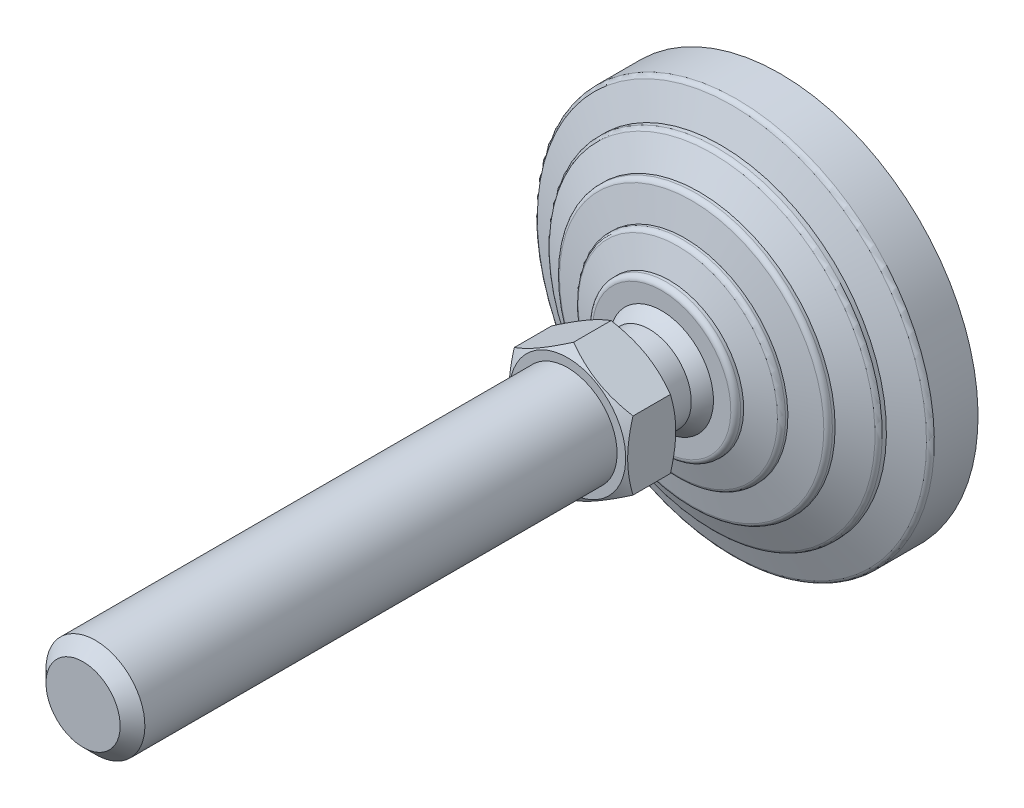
ISO-10303-21;
HEADER;
FILE_DESCRIPTION(('STEP AP214'),'2;1');
FILE_NAME('part.step','',(''),(''),'','','');
FILE_SCHEMA(('AUTOMOTIVE_DESIGN { 1 0 10303 214 1 1 1 1 }'));
ENDSEC;
DATA;
#1=APPLICATION_CONTEXT('core data for automotive mechanical design processes');
#2=APPLICATION_PROTOCOL_DEFINITION('international standard','automotive_design',2000,#1);
#3=PRODUCT_CONTEXT('',#1,'mechanical');
#4=PRODUCT('Part','Part','',(#3));
#5=PRODUCT_RELATED_PRODUCT_CATEGORY('part','',(#4));
#6=PRODUCT_DEFINITION_FORMATION('','',#4);
#7=PRODUCT_DEFINITION_CONTEXT('part definition',#1,'design');
#8=PRODUCT_DEFINITION('design','',#6,#7);
#9=PRODUCT_DEFINITION_SHAPE('','',#8);
#10=(LENGTH_UNIT() NAMED_UNIT(*) SI_UNIT(.MILLI.,.METRE.));
#11=(NAMED_UNIT(*) PLANE_ANGLE_UNIT() SI_UNIT($,.RADIAN.));
#12=(NAMED_UNIT(*) SI_UNIT($,.STERADIAN.) SOLID_ANGLE_UNIT());
#13=UNCERTAINTY_MEASURE_WITH_UNIT(LENGTH_MEASURE(1.E-05),#10,'distance_accuracy_value','');
#14=(GEOMETRIC_REPRESENTATION_CONTEXT(3) GLOBAL_UNCERTAINTY_ASSIGNED_CONTEXT((#13)) GLOBAL_UNIT_ASSIGNED_CONTEXT((#10,
#11,#12)) REPRESENTATION_CONTEXT('',''));
#15=CARTESIAN_POINT('',(0.,0.,0.));
#16=DIRECTION('',(0.,0.,1.));
#17=DIRECTION('',(1.,0.,0.));
#18=AXIS2_PLACEMENT_3D('',#15,#16,#17);
#19=CARTESIAN_POINT('',(-8.49999999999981,0.,35.9999999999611));
#20=DIRECTION('',(0.,0.,1.));
#21=DIRECTION('',(0.,-1.,0.));
#22=AXIS2_PLACEMENT_3D('',#19,#20,#21);
#23=PLANE('',#22);
#24=CARTESIAN_POINT('',(0.,0.,36.000000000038));
#25=DIRECTION('',(0.,0.,-1.));
#26=DIRECTION('',(-1.,0.,0.));
#27=AXIS2_PLACEMENT_3D('',#24,#25,#26);
#28=CIRCLE('',#27,11.75);
#29=CARTESIAN_POINT('',(-11.75,0.,36.000000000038));
#30=VERTEX_POINT('',#29);
#31=EDGE_CURVE('E596',#30,#30,#28,.T.);
#32=ORIENTED_EDGE('',*,*,#31,.T.);
#33=EDGE_LOOP('',(#32));
#34=FACE_BOUND('',#33,.T.);
#35=CARTESIAN_POINT('',(0.,0.,35.9999999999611));
#36=DIRECTION('',(0.,0.,-1.));
#37=DIRECTION('',(0.,1.,0.));
#38=AXIS2_PLACEMENT_3D('',#35,#36,#37);
#39=CIRCLE('',#38,8.49999999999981);
#40=CARTESIAN_POINT('',(0.,8.49999999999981,35.9999999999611));
#41=VERTEX_POINT('',#40);
#42=EDGE_CURVE('E156',#41,#41,#39,.T.);
#43=ORIENTED_EDGE('',*,*,#42,.F.);
#44=EDGE_LOOP('',(#43));
#45=FACE_BOUND('',#44,.T.);
#46=ADVANCED_FACE('F14',(#34,#45),#23,.F.);
#47=CARTESIAN_POINT('',(0.,0.,0.));
#48=DIRECTION('',(0.,0.,-1.));
#49=DIRECTION('',(0.,1.,0.));
#50=AXIS2_PLACEMENT_3D('',#47,#48,#49);
#51=CYLINDRICAL_SURFACE('',#50,8.49999999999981);
#52=CARTESIAN_POINT('',(0.,0.,29.4999999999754));
#53=DIRECTION('',(0.,0.,-1.));
#54=DIRECTION('',(0.,1.,0.));
#55=AXIS2_PLACEMENT_3D('',#52,#53,#54);
#56=CIRCLE('',#55,8.49999999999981);
#57=CARTESIAN_POINT('',(0.,8.49999999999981,29.4999999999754));
#58=VERTEX_POINT('',#57);
#59=EDGE_CURVE('E153',#58,#58,#56,.T.);
#60=ORIENTED_EDGE('',*,*,#59,.F.);
#61=EDGE_LOOP('',(#60));
#62=FACE_BOUND('',#61,.T.);
#63=ORIENTED_EDGE('',*,*,#42,.T.);
#64=EDGE_LOOP('',(#63));
#65=FACE_BOUND('',#64,.T.);
#66=ADVANCED_FACE('F180',(#62,#65),#51,.T.);
#67=CARTESIAN_POINT('',(-8.49107182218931,0.,29.4999999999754));
#68=DIRECTION('',(0.,0.,1.));
#69=DIRECTION('',(0.,-1.,0.));
#70=AXIS2_PLACEMENT_3D('',#67,#68,#69);
#71=PLANE('',#70);
#72=CARTESIAN_POINT('',(0.,0.,29.4999999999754));
#73=DIRECTION('',(0.,0.,-1.));
#74=DIRECTION('',(0.,1.,0.));
#75=AXIS2_PLACEMENT_3D('',#72,#73,#74);
#76=CIRCLE('',#75,8.49107182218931);
#77=CARTESIAN_POINT('',(-8.49107182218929,0.,29.4999999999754));
#78=VERTEX_POINT('',#77);
#79=EDGE_CURVE('E150',#78,#78,#76,.T.);
#80=ORIENTED_EDGE('',*,*,#79,.F.);
#81=EDGE_LOOP('',(#80));
#82=FACE_BOUND('',#81,.T.);
#83=ORIENTED_EDGE('',*,*,#59,.T.);
#84=EDGE_LOOP('',(#83));
#85=FACE_BOUND('',#84,.T.);
#86=ADVANCED_FACE('F187',(#82,#85),#71,.F.);
#87=CARTESIAN_POINT('',(-2.77555756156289E-12,0.,20.6702661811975));
#88=DIRECTION('',(0.,0.,-1.));
#89=DIRECTION('',(-1.,0.,0.));
#90=AXIS2_PLACEMENT_3D('',#87,#88,#89);
#91=SPHERICAL_SURFACE('',#90,12.25);
#92=CARTESIAN_POINT('',(0.,0.,27.));
#93=DIRECTION('',(0.,0.,-1.));
#94=DIRECTION('',(0.,1.,0.));
#95=AXIS2_PLACEMENT_3D('',#92,#93,#94);
#96=CIRCLE('',#95,10.4879440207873);
#97=CARTESIAN_POINT('',(-10.4879440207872,0.,27.));
#98=VERTEX_POINT('',#97);
#99=EDGE_CURVE('E147',#98,#98,#96,.T.);
#100=CARTESIAN_POINT('',(-10.4879440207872,0.,27.));
#101=CARTESIAN_POINT('',(-10.4706730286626,0.,27.0286168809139));
#102=CARTESIAN_POINT('',(-10.4532849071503,0.,27.0571630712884));
#103=CARTESIAN_POINT('',(-10.4182755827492,0.,27.1141121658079));
#104=CARTESIAN_POINT('',(-10.4006543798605,0.,27.1425150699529));
#105=CARTESIAN_POINT('',(-10.3651800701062,0.,27.1991756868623));
#106=CARTESIAN_POINT('',(-10.3473269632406,0.,27.2274333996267));
#107=CARTESIAN_POINT('',(-10.3113900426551,0.,27.283801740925));
#108=CARTESIAN_POINT('',(-10.2933062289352,0.,27.3119123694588));
#109=CARTESIAN_POINT('',(-10.2569091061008,0.,27.367984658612));
#110=CARTESIAN_POINT('',(-10.2385957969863,0.,27.3959463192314));
#111=CARTESIAN_POINT('',(-10.2017409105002,0.,27.4517187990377));
#112=CARTESIAN_POINT('',(-10.1831993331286,0.,27.4795296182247));
#113=CARTESIAN_POINT('',(-10.1458891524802,0.,27.5349985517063));
#114=CARTESIAN_POINT('',(-10.1271205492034,0.,27.5626566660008));
#115=CARTESIAN_POINT('',(-10.0893575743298,0.,27.6178183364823));
#116=CARTESIAN_POINT('',(-10.070363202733,0.,27.6453218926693));
#117=CARTESIAN_POINT('',(-10.0321499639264,0.,27.7001726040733));
#118=CARTESIAN_POINT('',(-10.0129310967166,0.,27.7275197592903));
#119=CARTESIAN_POINT('',(-9.97427015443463,0.,27.7820558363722));
#120=CARTESIAN_POINT('',(-9.95482807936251,0.,27.8092447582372));
#121=CARTESIAN_POINT('',(-9.9157220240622,0.,27.8634625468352));
#122=CARTESIAN_POINT('',(-9.89605804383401,0.,27.8904914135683));
#123=CARTESIAN_POINT('',(-9.85650949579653,0.,27.9443872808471));
#124=CARTESIAN_POINT('',(-9.83662492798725,0.,27.9712542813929));
#125=CARTESIAN_POINT('',(-9.79663653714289,0.,28.0248246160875));
#126=CARTESIAN_POINT('',(-9.77653271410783,0.,28.0515279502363));
#127=CARTESIAN_POINT('',(-9.73610715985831,0.,28.1047691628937));
#128=CARTESIAN_POINT('',(-9.71578542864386,0.,28.1313070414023));
#129=CARTESIAN_POINT('',(-9.67492541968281,0.,28.1842155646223));
#130=CARTESIAN_POINT('',(-9.65438714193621,0.,28.2105862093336));
#131=CARTESIAN_POINT('',(-9.61309541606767,0.,28.2631584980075));
#132=CARTESIAN_POINT('',(-9.59234196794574,0.,28.28936014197));
#133=CARTESIAN_POINT('',(-9.55062129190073,0.,28.3415926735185));
#134=CARTESIAN_POINT('',(-9.52965406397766,0.,28.3676235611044));
#135=CARTESIAN_POINT('',(-9.48750723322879,0.,28.4195128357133));
#136=CARTESIAN_POINT('',(-9.46632763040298,0.,28.4453712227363));
#137=CARTESIAN_POINT('',(-9.42375746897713,0.,28.4969137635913));
#138=CARTESIAN_POINT('',(-9.40236691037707,0.,28.5225979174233));
#139=CARTESIAN_POINT('',(-9.35937627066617,0.,28.5737902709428));
#140=CARTESIAN_POINT('',(-9.33777618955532,0.,28.5992984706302));
#141=CARTESIAN_POINT('',(-9.29436795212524,0.,28.6501372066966));
#142=CARTESIAN_POINT('',(-9.27255979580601,0.,28.6754677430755));
#143=CARTESIAN_POINT('',(-9.22873686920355,0.,28.7259494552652));
#144=CARTESIAN_POINT('',(-9.20672209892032,0.,28.751100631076));
#145=CARTESIAN_POINT('',(-9.16248741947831,0.,28.8012219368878));
#146=CARTESIAN_POINT('',(-9.14026751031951,0.,28.8261920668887));
#147=CARTESIAN_POINT('',(-9.0956240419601,0.,28.87594960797));
#148=CARTESIAN_POINT('',(-9.07320048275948,0.,28.9007370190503));
#149=CARTESIAN_POINT('',(-9.0281512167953,0.,28.9501274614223));
#150=CARTESIAN_POINT('',(-9.00552551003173,0.,28.9747304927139));
#151=CARTESIAN_POINT('',(-8.96007346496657,0.,29.023750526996));
#152=CARTESIAN_POINT('',(-8.93724712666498,0.,29.0481675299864));
#153=CARTESIAN_POINT('',(-8.89139534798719,0.,29.0968138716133));
#154=CARTESIAN_POINT('',(-8.868369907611,0.,29.1210432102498));
#155=CARTESIAN_POINT('',(-8.82212146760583,0.,29.1693125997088));
#156=CARTESIAN_POINT('',(-8.79889846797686,0.,29.1933526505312));
#157=CARTESIAN_POINT('',(-8.75225646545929,0.,29.2412418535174));
#158=CARTESIAN_POINT('',(-8.72883746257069,0.,29.2650910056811));
#159=CARTESIAN_POINT('',(-8.68180502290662,0.,29.3125968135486));
#160=CARTESIAN_POINT('',(-8.65819158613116,0.,29.3362534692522));
#161=CARTESIAN_POINT('',(-8.61077186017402,0.,29.383372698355));
#162=CARTESIAN_POINT('',(-8.58696557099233,0.,29.4068352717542));
#163=CARTESIAN_POINT('',(-8.53916173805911,0.,29.4535647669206));
#164=CARTESIAN_POINT('',(-8.51516419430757,0.,29.4768316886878));
#165=CARTESIAN_POINT('',(-8.49107182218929,0.,29.4999999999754));
#166=B_SPLINE_CURVE_WITH_KNOTS('',3,(#100,#101,#102,#103,#104,#105,#106,#107,#108,#109,#110,
#111,#112,#113,#114,#115,#116,#117,#118,#119,#120,#121,#122,#123,#124,#125,#126,#127,#128,#129,
#130,#131,#132,#133,#134,#135,#136,#137,#138,#139,#140,#141,#142,#143,#144,#145,#146,#147,#148,
#149,#150,#151,#152,#153,#154,#155,#156,#157,#158,#159,#160,#161,#162,#163,#164,#165),
.UNSPECIFIED.,.F.,.F.,(4,2,2,2,2,2,2,2,2,2,2,2,2,2,2,2,2,2,2,2,2,2,2,2,2,2,2,2,2,2,2,2,4),(0.,
0.100273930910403,0.200547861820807,0.30082179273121,0.401095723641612,0.501369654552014,
0.601643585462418,0.701917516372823,0.802191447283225,0.902465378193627,1.00273930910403,
1.10301324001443,1.20328717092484,1.30356110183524,1.40383503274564,1.50410896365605,
1.60438289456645,1.70465682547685,1.80493075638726,1.90520468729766,2.00547861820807,
2.10575254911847,2.20602648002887,2.30630041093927,2.40657434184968,2.50684827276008,
2.60712220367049,2.70739613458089,2.80767006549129,2.90794399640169,3.0082179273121,
3.1084918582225,3.2087657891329),.UNSPECIFIED.);
#167=EDGE_CURVE('BSEAM459',#98,#78,#166,.T.);
#168=ORIENTED_EDGE('',*,*,#99,.F.);
#169=ORIENTED_EDGE('',*,*,#79,.T.);
#170=ORIENTED_EDGE('',*,*,#167,.T.);
#171=ORIENTED_EDGE('',*,*,#167,.F.);
#172=EDGE_LOOP('',(#168,#170,#169,#171));
#173=FACE_BOUND('',#172,.T.);
#174=ADVANCED_FACE('F459',(#173),#91,.T.);
#175=CARTESIAN_POINT('',(-10.4879440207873,0.,27.));
#176=DIRECTION('',(0.,0.,-1.));
#177=DIRECTION('',(0.,1.,0.));
#178=AXIS2_PLACEMENT_3D('',#175,#176,#177);
#179=PLANE('',#178);
#180=CARTESIAN_POINT('',(0.,0.,27.));
#181=DIRECTION('',(0.,0.,-1.));
#182=DIRECTION('',(0.,1.,0.));
#183=AXIS2_PLACEMENT_3D('',#180,#181,#182);
#184=CIRCLE('',#183,13.9999999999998);
#185=CARTESIAN_POINT('',(0.,13.9999999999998,27.));
#186=VERTEX_POINT('',#185);
#187=EDGE_CURVE('E144',#186,#186,#184,.T.);
#188=ORIENTED_EDGE('',*,*,#187,.F.);
#189=EDGE_LOOP('',(#188));
#190=FACE_BOUND('',#189,.T.);
#191=ORIENTED_EDGE('',*,*,#99,.T.);
#192=EDGE_LOOP('',(#191));
#193=FACE_BOUND('',#192,.T.);
#194=ADVANCED_FACE('F449',(#190,#193),#179,.F.);
#195=CARTESIAN_POINT('',(0.,0.,26.));
#196=DIRECTION('',(0.,0.,-1.));
#197=DIRECTION('',(0.,1.,0.));
#198=AXIS2_PLACEMENT_3D('',#195,#196,#197);
#199=TOROIDAL_SURFACE('',#198,13.9999999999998,1.);
#200=CARTESIAN_POINT('',(0.,0.,26.));
#201=DIRECTION('',(0.,0.,-1.));
#202=DIRECTION('',(0.,1.,0.));
#203=AXIS2_PLACEMENT_3D('',#200,#201,#202);
#204=CIRCLE('',#203,14.9999999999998);
#205=CARTESIAN_POINT('',(0.,14.9999999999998,26.));
#206=VERTEX_POINT('',#205);
#207=EDGE_CURVE('E141',#206,#206,#204,.T.);
#208=ORIENTED_EDGE('',*,*,#207,.F.);
#209=EDGE_LOOP('',(#208));
#210=FACE_BOUND('',#209,.T.);
#211=ORIENTED_EDGE('',*,*,#187,.T.);
#212=EDGE_LOOP('',(#211));
#213=FACE_BOUND('',#212,.T.);
#214=ADVANCED_FACE('F439',(#210,#213),#199,.T.);
#215=CARTESIAN_POINT('',(0.,0.,0.));
#216=DIRECTION('',(0.,0.,-1.));
#217=DIRECTION('',(0.,1.,0.));
#218=AXIS2_PLACEMENT_3D('',#215,#216,#217);
#219=CYLINDRICAL_SURFACE('',#218,14.9999999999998);
#220=CARTESIAN_POINT('',(0.,0.,25.4025287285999));
#221=DIRECTION('',(0.,0.,-1.));
#222=DIRECTION('',(0.,1.,0.));
#223=AXIS2_PLACEMENT_3D('',#220,#221,#222);
#224=CIRCLE('',#223,14.9999999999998);
#225=CARTESIAN_POINT('',(0.,14.9999999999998,25.4025287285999));
#226=VERTEX_POINT('',#225);
#227=EDGE_CURVE('E138',#226,#226,#224,.T.);
#228=ORIENTED_EDGE('',*,*,#227,.F.);
#229=EDGE_LOOP('',(#228));
#230=FACE_BOUND('',#229,.T.);
#231=ORIENTED_EDGE('',*,*,#207,.T.);
#232=EDGE_LOOP('',(#231));
#233=FACE_BOUND('',#232,.T.);
#234=ADVANCED_FACE('F429',(#230,#233),#219,.T.);
#235=CARTESIAN_POINT('',(0.,0.,25.4025287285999));
#236=DIRECTION('',(0.,0.,-1.));
#237=DIRECTION('',(0.,1.,0.));
#238=AXIS2_PLACEMENT_3D('',#235,#236,#237);
#239=CONICAL_SURFACE('',#238,14.9999999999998,1.25589726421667);
#240=CARTESIAN_POINT('',(0.,0.,23.7216684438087));
#241=DIRECTION('',(0.,0.,-1.));
#242=DIRECTION('',(0.,1.,0.));
#243=AXIS2_PLACEMENT_3D('',#240,#241,#242);
#244=CIRCLE('',#243,20.1601635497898);
#245=CARTESIAN_POINT('',(0.,20.1601635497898,23.7216684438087));
#246=VERTEX_POINT('',#245);
#247=EDGE_CURVE('E135',#246,#246,#244,.T.);
#248=ORIENTED_EDGE('',*,*,#247,.F.);
#249=EDGE_LOOP('',(#248));
#250=FACE_BOUND('',#249,.T.);
#251=ORIENTED_EDGE('',*,*,#227,.T.);
#252=EDGE_LOOP('',(#251));
#253=FACE_BOUND('',#252,.T.);
#254=ADVANCED_FACE('F419',(#250,#253),#239,.T.);
#255=CARTESIAN_POINT('',(0.,0.,22.7708407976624));
#256=DIRECTION('',(0.,0.,-1.));
#257=DIRECTION('',(0.,1.,0.));
#258=AXIS2_PLACEMENT_3D('',#255,#256,#257);
#259=TOROIDAL_SURFACE('',#258,19.8504430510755,1.);
#260=CARTESIAN_POINT('',(0.,0.,22.7708407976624));
#261=DIRECTION('',(0.,0.,-1.));
#262=DIRECTION('',(0.,1.,0.));
#263=AXIS2_PLACEMENT_3D('',#260,#261,#262);
#264=CIRCLE('',#263,20.8504430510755);
#265=CARTESIAN_POINT('',(0.,20.8504430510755,22.7708407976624));
#266=VERTEX_POINT('',#265);
#267=EDGE_CURVE('E132',#266,#266,#264,.T.);
#268=ORIENTED_EDGE('',*,*,#267,.F.);
#269=EDGE_LOOP('',(#268));
#270=FACE_BOUND('',#269,.T.);
#271=ORIENTED_EDGE('',*,*,#247,.T.);
#272=EDGE_LOOP('',(#271));
#273=FACE_BOUND('',#272,.T.);
#274=ADVANCED_FACE('F409',(#270,#273),#259,.T.);
#275=CARTESIAN_POINT('',(0.,0.,0.));
#276=DIRECTION('',(0.,0.,-1.));
#277=DIRECTION('',(0.,1.,0.));
#278=AXIS2_PLACEMENT_3D('',#275,#276,#277);
#279=CYLINDRICAL_SURFACE('',#278,20.8504430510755);
#280=CARTESIAN_POINT('',(0.,0.,22.2987385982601));
#281=DIRECTION('',(0.,0.,-1.));
#282=DIRECTION('',(0.,1.,0.));
#283=AXIS2_PLACEMENT_3D('',#280,#281,#282);
#284=CIRCLE('',#283,20.8504430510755);
#285=CARTESIAN_POINT('',(0.,20.8504430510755,22.2987385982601));
#286=VERTEX_POINT('',#285);
#287=EDGE_CURVE('E129',#286,#286,#284,.T.);
#288=ORIENTED_EDGE('',*,*,#287,.F.);
#289=EDGE_LOOP('',(#288));
#290=FACE_BOUND('',#289,.T.);
#291=ORIENTED_EDGE('',*,*,#267,.T.);
#292=EDGE_LOOP('',(#291));
#293=FACE_BOUND('',#292,.T.);
#294=ADVANCED_FACE('F399',(#290,#293),#279,.T.);
#295=CARTESIAN_POINT('',(0.,0.,22.2987385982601));
#296=DIRECTION('',(0.,0.,-1.));
#297=DIRECTION('',(0.,1.,0.));
#298=AXIS2_PLACEMENT_3D('',#295,#296,#297);
#299=CONICAL_SURFACE('',#298,20.8504430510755,1.34067144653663);
#300=CARTESIAN_POINT('',(0.,0.,20.9217501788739));
#301=DIRECTION('',(0.,0.,-1.));
#302=DIRECTION('',(0.,1.,0.));
#303=AXIS2_PLACEMENT_3D('',#300,#301,#302);
#304=CIRCLE('',#303,26.7280991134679);
#305=CARTESIAN_POINT('',(0.,26.7280991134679,20.9217501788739));
#306=VERTEX_POINT('',#305);
#307=EDGE_CURVE('E126',#306,#306,#304,.T.);
#308=ORIENTED_EDGE('',*,*,#307,.F.);
#309=EDGE_LOOP('',(#308));
#310=FACE_BOUND('',#309,.T.);
#311=ORIENTED_EDGE('',*,*,#287,.T.);
#312=EDGE_LOOP('',(#311));
#313=FACE_BOUND('',#312,.T.);
#314=ADVANCED_FACE('F389',(#310,#313),#299,.T.);
#315=CARTESIAN_POINT('',(0.,0.,19.9481122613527));
#316=DIRECTION('',(0.,0.,-1.));
#317=DIRECTION('',(0.,1.,0.));
#318=AXIS2_PLACEMENT_3D('',#315,#316,#317);
#319=TOROIDAL_SURFACE('',#318,26.5,1.00000000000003);
#320=CARTESIAN_POINT('',(0.,0.,19.9481122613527));
#321=DIRECTION('',(0.,0.,-1.));
#322=DIRECTION('',(0.,1.,0.));
#323=AXIS2_PLACEMENT_3D('',#320,#321,#322);
#324=CIRCLE('',#323,27.5);
#325=CARTESIAN_POINT('',(0.,27.5,19.9481122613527));
#326=VERTEX_POINT('',#325);
#327=EDGE_CURVE('E123',#326,#326,#324,.T.);
#328=ORIENTED_EDGE('',*,*,#327,.F.);
#329=EDGE_LOOP('',(#328));
#330=FACE_BOUND('',#329,.T.);
#331=ORIENTED_EDGE('',*,*,#307,.T.);
#332=EDGE_LOOP('',(#331));
#333=FACE_BOUND('',#332,.T.);
#334=ADVANCED_FACE('F379',(#330,#333),#319,.T.);
#335=CARTESIAN_POINT('',(0.,0.,0.));
#336=DIRECTION('',(0.,0.,-1.));
#337=DIRECTION('',(0.,1.,0.));
#338=AXIS2_PLACEMENT_3D('',#335,#336,#337);
#339=CYLINDRICAL_SURFACE('',#338,27.5);
#340=CARTESIAN_POINT('',(0.,0.,19.4025287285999));
#341=DIRECTION('',(0.,0.,-1.));
#342=DIRECTION('',(0.,1.,0.));
#343=AXIS2_PLACEMENT_3D('',#340,#341,#342);
#344=CIRCLE('',#343,27.5);
#345=CARTESIAN_POINT('',(0.,27.5,19.4025287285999));
#346=VERTEX_POINT('',#345);
#347=EDGE_CURVE('E120',#346,#346,#344,.T.);
#348=ORIENTED_EDGE('',*,*,#347,.F.);
#349=EDGE_LOOP('',(#348));
#350=FACE_BOUND('',#349,.T.);
#351=ORIENTED_EDGE('',*,*,#327,.T.);
#352=EDGE_LOOP('',(#351));
#353=FACE_BOUND('',#352,.T.);
#354=ADVANCED_FACE('F369',(#350,#353),#339,.T.);
#355=CARTESIAN_POINT('',(0.,0.,19.4025287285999));
#356=DIRECTION('',(0.,0.,-1.));
#357=DIRECTION('',(0.,1.,0.));
#358=AXIS2_PLACEMENT_3D('',#355,#356,#357);
#359=CONICAL_SURFACE('',#358,27.5,1.1202291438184);
#360=CARTESIAN_POINT('',(0.,0.,16.7730910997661));
#361=DIRECTION('',(0.,0.,-1.));
#362=DIRECTION('',(0.,1.,0.));
#363=AXIS2_PLACEMENT_3D('',#360,#361,#362);
#364=CIRCLE('',#363,32.935476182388);
#365=CARTESIAN_POINT('',(0.,32.935476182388,16.7730910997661));
#366=VERTEX_POINT('',#365);
#367=EDGE_CURVE('E117',#366,#366,#364,.T.);
#368=ORIENTED_EDGE('',*,*,#367,.F.);
#369=EDGE_LOOP('',(#368));
#370=FACE_BOUND('',#369,.T.);
#371=ORIENTED_EDGE('',*,*,#347,.T.);
#372=EDGE_LOOP('',(#371));
#373=FACE_BOUND('',#372,.T.);
#374=ADVANCED_FACE('F359',(#370,#373),#359,.T.);
#375=CARTESIAN_POINT('',(0.,0.,15.8728908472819));
#376=DIRECTION('',(0.,0.,-1.));
#377=DIRECTION('',(0.,1.,0.));
#378=AXIS2_PLACEMENT_3D('',#375,#376,#377);
#379=TOROIDAL_SURFACE('',#378,32.5,0.999999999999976);
#380=CARTESIAN_POINT('',(0.,0.,15.8728908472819));
#381=DIRECTION('',(0.,0.,-1.));
#382=DIRECTION('',(0.,1.,0.));
#383=AXIS2_PLACEMENT_3D('',#380,#381,#382);
#384=CIRCLE('',#383,33.5);
#385=CARTESIAN_POINT('',(0.,33.5,15.8728908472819));
#386=VERTEX_POINT('',#385);
#387=EDGE_CURVE('E114',#386,#386,#384,.T.);
#388=ORIENTED_EDGE('',*,*,#387,.F.);
#389=EDGE_LOOP('',(#388));
#390=FACE_BOUND('',#389,.T.);
#391=ORIENTED_EDGE('',*,*,#367,.T.);
#392=EDGE_LOOP('',(#391));
#393=FACE_BOUND('',#392,.T.);
#394=ADVANCED_FACE('F349',(#390,#393),#379,.T.);
#395=CARTESIAN_POINT('',(0.,0.,0.));
#396=DIRECTION('',(0.,0.,-1.));
#397=DIRECTION('',(0.,1.,0.));
#398=AXIS2_PLACEMENT_3D('',#395,#396,#397);
#399=CYLINDRICAL_SURFACE('',#398,33.5);
#400=CARTESIAN_POINT('',(0.,0.,15.0315037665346));
#401=DIRECTION('',(0.,0.,-1.));
#402=DIRECTION('',(0.,1.,0.));
#403=AXIS2_PLACEMENT_3D('',#400,#401,#402);
#404=CIRCLE('',#403,33.5);
#405=CARTESIAN_POINT('',(0.,33.5,15.0315037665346));
#406=VERTEX_POINT('',#405);
#407=EDGE_CURVE('E111',#406,#406,#404,.T.);
#408=ORIENTED_EDGE('',*,*,#407,.F.);
#409=EDGE_LOOP('',(#408));
#410=FACE_BOUND('',#409,.T.);
#411=ORIENTED_EDGE('',*,*,#387,.T.);
#412=EDGE_LOOP('',(#411));
#413=FACE_BOUND('',#412,.T.);
#414=ADVANCED_FACE('F339',(#410,#413),#399,.T.);
#415=CARTESIAN_POINT('',(0.,0.,15.0315037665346));
#416=DIRECTION('',(0.,0.,-1.));
#417=DIRECTION('',(0.,1.,0.));
#418=AXIS2_PLACEMENT_3D('',#415,#416,#417);
#419=CONICAL_SURFACE('',#418,33.5,1.20362249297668);
#420=CARTESIAN_POINT('',(0.,0.,12.7780502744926));
#421=DIRECTION('',(0.,0.,-1.));
#422=DIRECTION('',(0.,1.,0.));
#423=AXIS2_PLACEMENT_3D('',#420,#421,#422);
#424=CIRCLE('',#423,39.3589790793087);
#425=CARTESIAN_POINT('',(0.,39.3589790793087,12.7780502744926));
#426=VERTEX_POINT('',#425);
#427=EDGE_CURVE('E108',#426,#426,#424,.T.);
#428=ORIENTED_EDGE('',*,*,#427,.F.);
#429=EDGE_LOOP('',(#428));
#430=FACE_BOUND('',#429,.T.);
#431=ORIENTED_EDGE('',*,*,#407,.T.);
#432=EDGE_LOOP('',(#431));
#433=FACE_BOUND('',#432,.T.);
#434=ADVANCED_FACE('F329',(#430,#433),#419,.T.);
#435=CARTESIAN_POINT('',(0.,0.,11.8447046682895));
#436=DIRECTION('',(0.,0.,-1.));
#437=DIRECTION('',(0.,1.,0.));
#438=AXIS2_PLACEMENT_3D('',#435,#436,#437);
#439=TOROIDAL_SURFACE('',#438,39.,1.00000000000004);
#440=CARTESIAN_POINT('',(0.,0.,11.8447046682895));
#441=DIRECTION('',(0.,0.,-1.));
#442=DIRECTION('',(0.,1.,0.));
#443=AXIS2_PLACEMENT_3D('',#440,#441,#442);
#444=CIRCLE('',#443,40.);
#445=CARTESIAN_POINT('',(0.,40.,11.8447046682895));
#446=VERTEX_POINT('',#445);
#447=EDGE_CURVE('E105',#446,#446,#444,.T.);
#448=ORIENTED_EDGE('',*,*,#447,.F.);
#449=EDGE_LOOP('',(#448));
#450=FACE_BOUND('',#449,.T.);
#451=ORIENTED_EDGE('',*,*,#427,.T.);
#452=EDGE_LOOP('',(#451));
#453=FACE_BOUND('',#452,.T.);
#454=ADVANCED_FACE('F319',(#450,#453),#439,.T.);
#455=CARTESIAN_POINT('',(0.,0.,0.));
#456=DIRECTION('',(0.,0.,-1.));
#457=DIRECTION('',(0.,1.,0.));
#458=AXIS2_PLACEMENT_3D('',#455,#456,#457);
#459=CYLINDRICAL_SURFACE('',#458,40.);
#460=CARTESIAN_POINT('',(0.,0.,3.));
#461=DIRECTION('',(0.,0.,-1.));
#462=DIRECTION('',(0.,1.,0.));
#463=AXIS2_PLACEMENT_3D('',#460,#461,#462);
#464=CIRCLE('',#463,40.);
#465=CARTESIAN_POINT('',(0.,40.,3.));
#466=VERTEX_POINT('',#465);
#467=EDGE_CURVE('E102',#466,#466,#464,.T.);
#468=ORIENTED_EDGE('',*,*,#467,.F.);
#469=EDGE_LOOP('',(#468));
#470=FACE_BOUND('',#469,.T.);
#471=ORIENTED_EDGE('',*,*,#447,.T.);
#472=EDGE_LOOP('',(#471));
#473=FACE_BOUND('',#472,.T.);
#474=ADVANCED_FACE('F309',(#470,#473),#459,.T.);
#475=CARTESIAN_POINT('',(-33.5,0.,3.));
#476=DIRECTION('',(0.,0.,1.));
#477=DIRECTION('',(0.,-1.,0.));
#478=AXIS2_PLACEMENT_3D('',#475,#476,#477);
#479=PLANE('',#478);
#480=CARTESIAN_POINT('',(0.,0.,3.));
#481=DIRECTION('',(0.,0.,-1.));
#482=DIRECTION('',(0.,1.,0.));
#483=AXIS2_PLACEMENT_3D('',#480,#481,#482);
#484=CIRCLE('',#483,33.5);
#485=CARTESIAN_POINT('',(0.,33.5,3.));
#486=VERTEX_POINT('',#485);
#487=EDGE_CURVE('E99',#486,#486,#484,.T.);
#488=ORIENTED_EDGE('',*,*,#487,.F.);
#489=EDGE_LOOP('',(#488));
#490=FACE_BOUND('',#489,.T.);
#491=ORIENTED_EDGE('',*,*,#467,.T.);
#492=EDGE_LOOP('',(#491));
#493=FACE_BOUND('',#492,.T.);
#494=ADVANCED_FACE('F299',(#490,#493),#479,.F.);
#495=CARTESIAN_POINT('',(0.,0.,0.));
#496=DIRECTION('',(0.,0.,-1.));
#497=DIRECTION('',(0.,1.,0.));
#498=AXIS2_PLACEMENT_3D('',#495,#496,#497);
#499=CYLINDRICAL_SURFACE('',#498,33.5);
#500=CARTESIAN_POINT('',(0.,0.,0.));
#501=DIRECTION('',(0.,0.,-1.));
#502=DIRECTION('',(0.,1.,0.));
#503=AXIS2_PLACEMENT_3D('',#500,#501,#502);
#504=CIRCLE('',#503,33.5);
#505=CARTESIAN_POINT('',(0.,33.5,0.));
#506=VERTEX_POINT('',#505);
#507=EDGE_CURVE('E96',#506,#506,#504,.T.);
#508=ORIENTED_EDGE('',*,*,#507,.F.);
#509=EDGE_LOOP('',(#508));
#510=FACE_BOUND('',#509,.T.);
#511=ORIENTED_EDGE('',*,*,#487,.T.);
#512=EDGE_LOOP('',(#511));
#513=FACE_BOUND('',#512,.T.);
#514=ADVANCED_FACE('F288',(#510,#513),#499,.T.);
#515=CARTESIAN_POINT('',(0.,0.,0.));
#516=DIRECTION('',(0.,0.,1.));
#517=DIRECTION('',(0.,-1.,0.));
#518=AXIS2_PLACEMENT_3D('',#515,#516,#517);
#519=PLANE('',#518);
#520=ORIENTED_EDGE('',*,*,#507,.T.);
#521=EDGE_LOOP('',(#520));
#522=FACE_BOUND('',#521,.T.);
#523=ADVANCED_FACE('F178',(#522),#519,.F.);
#524=CARTESIAN_POINT('',(0.,0.,38.6031589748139));
#525=DIRECTION('',(0.,0.,1.));
#526=DIRECTION('',(1.,0.,0.));
#527=AXIS2_PLACEMENT_3D('',#524,#525,#526);
#528=CONICAL_SURFACE('',#527,16.2588036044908,1.0471975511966);
#529=CARTESIAN_POINT('',(0.437361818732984,-14.1089174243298,37.3658344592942));
#530=CARTESIAN_POINT('',(0.157250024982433,-13.9471948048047,37.2675215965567));
#531=CARTESIAN_POINT('',(-0.123954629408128,-13.784841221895,37.1734195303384));
#532=CARTESIAN_POINT('',(-0.688809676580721,-13.4587220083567,36.9949257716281));
#533=CARTESIAN_POINT('',(-0.972461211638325,-13.2949557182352,36.9105389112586));
#534=CARTESIAN_POINT('',(-1.82865171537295,-12.8006339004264,36.6735862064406));
#535=CARTESIAN_POINT('',(-2.40486070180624,-12.4679594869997,36.5377934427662));
#536=CARTESIAN_POINT('',(-3.2665868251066,-11.9704416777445,36.3777043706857));
#537=CARTESIAN_POINT('',(-3.54918847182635,-11.8072815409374,36.331984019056));
#538=CARTESIAN_POINT('',(-4.1158823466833,-11.4801006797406,36.2548537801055));
#539=CARTESIAN_POINT('',(-4.39997459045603,-11.3160799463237,36.2234440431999));
#540=CARTESIAN_POINT('',(-4.96865671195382,-10.9877511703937,36.1758349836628));
#541=CARTESIAN_POINT('',(-5.25324504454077,-10.8234440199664,36.159611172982));
#542=CARTESIAN_POINT('',(-5.82277057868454,-10.4946282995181,36.1427491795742));
#543=CARTESIAN_POINT('',(-6.10770778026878,-10.3301197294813,36.1421109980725));
#544=CARTESIAN_POINT('',(-6.69518494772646,-9.99093962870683,36.1568935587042));
#545=CARTESIAN_POINT('',(-6.99770598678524,-9.81627902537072,36.1733258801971));
#546=CARTESIAN_POINT('',(-7.60168454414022,-9.46757184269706,36.2232915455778));
#547=CARTESIAN_POINT('',(-7.90314202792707,-9.2935252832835,36.2568254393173));
#548=CARTESIAN_POINT('',(-8.50495321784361,-8.94606943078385,36.3400517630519));
#549=CARTESIAN_POINT('',(-8.80530368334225,-8.77266200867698,36.3897751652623));
#550=CARTESIAN_POINT('',(-9.40386830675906,-8.4270805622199,36.5039951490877));
#551=CARTESIAN_POINT('',(-9.70208249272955,-8.25490652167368,36.5684915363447));
#552=CARTESIAN_POINT('',(-10.3056181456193,-7.90645505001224,36.7129924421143));
#553=CARTESIAN_POINT('',(-10.6108618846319,-7.7302224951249,36.7934269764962));
#554=CARTESIAN_POINT('',(-11.2187202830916,-7.37927528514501,36.9666767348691));
#555=CARTESIAN_POINT('',(-11.5213346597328,-7.20456079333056,37.0594932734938));
#556=CARTESIAN_POINT('',(-12.1226764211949,-6.85737596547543,37.2554423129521));
#557=CARTESIAN_POINT('',(-12.4214147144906,-6.68489933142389,37.358530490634));
#558=CARTESIAN_POINT('',(-13.0162878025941,-6.34144919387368,37.5738640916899));
#559=CARTESIAN_POINT('',(-13.3124235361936,-6.17047514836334,37.6861060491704));
#560=CARTESIAN_POINT('',(-13.6073773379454,-6.00018349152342,37.8022261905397));
#561=B_SPLINE_CURVE_WITH_KNOTS('',3,(#529,#530,#531,#532,#533,#534,#535,#536,#537,#538,#539,
#540,#541,#542,#543,#544,#545,#546,#547,#548,#549,#550,#551,#552,#553,#554,#555,#556,#557,#558,
#559,#560),.UNSPECIFIED.,.F.,.F.,(4,2,2,2,2,2,2,2,2,2,2,2,2,2,2,4),(0.,1.01408520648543,
2.02867263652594,4.06352146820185,5.05179065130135,6.04007022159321,7.0267533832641,
8.01343662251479,9.06211793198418,10.1108329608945,11.1615661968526,12.2122856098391,
13.2966095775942,14.3810487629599,15.4609959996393,16.540536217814),.UNSPECIFIED.);
#562=CARTESIAN_POINT('',(0.,-13.856406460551,37.2161343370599));
#563=VERTEX_POINT('',#562);
#564=CARTESIAN_POINT('',(-12.,-6.92820323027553,37.2161343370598));
#565=VERTEX_POINT('',#564);
#566=EDGE_CURVE('E73',#563,#565,#561,.T.);
#567=ORIENTED_EDGE('',*,*,#566,.T.);
#568=CARTESIAN_POINT('',(-12.,-18.5475398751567,41.9703654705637));
#569=CARTESIAN_POINT('',(-12.,-18.2857514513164,41.8434681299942));
#570=CARTESIAN_POINT('',(-12.,-18.0236541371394,41.7172083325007));
#571=CARTESIAN_POINT('',(-12.,-17.4987772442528,41.4661083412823));
#572=CARTESIAN_POINT('',(-12.,-17.235997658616,41.341268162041));
#573=CARTESIAN_POINT('',(-12.,-16.4464679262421,40.9690605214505));
#574=CARTESIAN_POINT('',(-12.,-15.9186052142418,40.7240440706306));
#575=CARTESIAN_POINT('',(-12.,-14.8564236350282,40.2404415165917));
#576=CARTESIAN_POINT('',(-12.,-14.3220852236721,40.0018982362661));
#577=CARTESIAN_POINT('',(-12.,-13.2491370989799,39.5346535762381));
#578=CARTESIAN_POINT('',(-12.,-12.7105275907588,39.3059517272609));
#579=CARTESIAN_POINT('',(-12.,-11.6110324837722,38.853946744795));
#580=CARTESIAN_POINT('',(-12.,-11.0499815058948,38.6310437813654));
#581=CARTESIAN_POINT('',(-12.,-9.92128856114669,38.2022589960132));
#582=CARTESIAN_POINT('',(-12.,-9.35364585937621,37.9963790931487));
#583=CARTESIAN_POINT('',(-12.,-8.21196792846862,37.6070940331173));
#584=CARTESIAN_POINT('',(-12.,-7.6379485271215,37.4236428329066));
#585=CARTESIAN_POINT('',(-12.,-6.48162146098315,37.0851330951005));
#586=CARTESIAN_POINT('',(-12.,-5.89931648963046,36.9300655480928));
#587=CARTESIAN_POINT('',(-12.,-5.0211565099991,36.7248170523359));
#588=CARTESIAN_POINT('',(-12.,-4.72844680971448,36.6610947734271));
#589=CARTESIAN_POINT('',(-12.,-4.14103915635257,36.5435330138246));
#590=CARTESIAN_POINT('',(-12.,-3.84634124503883,36.4896933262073));
#591=CARTESIAN_POINT('',(-12.,-3.25516452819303,36.3928508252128));
#592=CARTESIAN_POINT('',(-12.,-2.95868574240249,36.3498478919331));
#593=CARTESIAN_POINT('',(-12.,-2.36426705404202,36.2755391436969));
#594=CARTESIAN_POINT('',(-12.,-2.06632720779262,36.2442328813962));
#595=CARTESIAN_POINT('',(-12.,-1.47326510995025,36.1943284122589));
#596=CARTESIAN_POINT('',(-12.,-1.17815634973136,36.1755708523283));
#597=CARTESIAN_POINT('',(-12.,-0.587410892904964,36.1505481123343));
#598=CARTESIAN_POINT('',(-12.,-0.29177420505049,36.1442827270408));
#599=CARTESIAN_POINT('',(-12.,0.299500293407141,36.1443931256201));
#600=CARTESIAN_POINT('',(-12.,0.595138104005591,36.1507689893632));
#601=CARTESIAN_POINT('',(-12.,1.18588381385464,36.1760074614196));
#602=CARTESIAN_POINT('',(-12.,1.4809916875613,36.1948706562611));
#603=CARTESIAN_POINT('',(-12.,2.19213411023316,36.2549751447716));
#604=CARTESIAN_POINT('',(-12.,2.6076677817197,36.3022470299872));
#605=CARTESIAN_POINT('',(-12.,3.43561227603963,36.4189594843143));
#606=CARTESIAN_POINT('',(-12.,3.84802265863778,36.4884031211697));
#607=CARTESIAN_POINT('',(-12.,4.66934090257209,36.6469885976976));
#608=CARTESIAN_POINT('',(-12.,5.07824573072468,36.7361459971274));
#609=CARTESIAN_POINT('',(-12.,5.89193456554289,36.9314419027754));
#610=CARTESIAN_POINT('',(-12.,6.29671863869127,37.0375801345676));
#611=CARTESIAN_POINT('',(-12.,7.11102190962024,37.2667546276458));
#612=CARTESIAN_POINT('',(-12.,7.52045065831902,37.3901100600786));
#613=CARTESIAN_POINT('',(-12.,8.335274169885,37.649426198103));
#614=CARTESIAN_POINT('',(-12.,8.74066890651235,37.7853869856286));
#615=CARTESIAN_POINT('',(-12.,9.54762712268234,38.0677673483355));
#616=CARTESIAN_POINT('',(-12.,9.94919185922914,38.2141833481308));
#617=CARTESIAN_POINT('',(-12.,10.7490033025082,38.5157653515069));
#618=CARTESIAN_POINT('',(-12.,11.1472500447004,38.6709312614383));
#619=CARTESIAN_POINT('',(-12.,12.0729667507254,39.0414593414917));
#620=CARTESIAN_POINT('',(-12.,12.5992994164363,39.2596583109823));
#621=CARTESIAN_POINT('',(-12.,13.647603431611,39.7063217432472));
#622=CARTESIAN_POINT('',(-12.,14.1695745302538,39.9347867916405));
#623=CARTESIAN_POINT('',(-12.,15.2099489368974,40.399965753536));
#624=CARTESIAN_POINT('',(-12.,15.7283514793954,40.6366813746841));
#625=CARTESIAN_POINT('',(-12.,16.7620638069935,41.116729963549));
#626=CARTESIAN_POINT('',(-12.,17.2773736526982,41.3600628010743));
#627=CARTESIAN_POINT('',(-12.,18.3059375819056,41.8523863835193));
#628=CARTESIAN_POINT('',(-12.,18.8191889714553,42.1013827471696));
#629=CARTESIAN_POINT('',(-12.,19.8435031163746,42.6038362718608));
#630=CARTESIAN_POINT('',(-12.,20.354565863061,42.8572934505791));
#631=CARTESIAN_POINT('',(-12.,21.3747719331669,43.3678857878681));
#632=CARTESIAN_POINT('',(-12.,21.8839154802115,43.6250205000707));
#633=CARTESIAN_POINT('',(-12.,22.9006178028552,44.1424058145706));
#634=CARTESIAN_POINT('',(-12.,23.4081765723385,44.4026564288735));
#635=CARTESIAN_POINT('',(-12.,24.8461079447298,45.1446635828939));
#636=CARTESIAN_POINT('',(-12.,25.7748728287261,45.6295357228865));
#637=CARTESIAN_POINT('',(-12.,27.6289355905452,46.6059219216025));
#638=CARTESIAN_POINT('',(-12.,28.5542333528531,47.0974361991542));
#639=CARTESIAN_POINT('',(-12.,30.399899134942,48.0843891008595));
#640=CARTESIAN_POINT('',(-12.,31.3202736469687,48.5798155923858));
#641=CARTESIAN_POINT('',(-12.,32.6991928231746,49.3259299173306));
#642=CARTESIAN_POINT('',(-12.,33.1585469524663,49.5751239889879));
#643=CARTESIAN_POINT('',(-12.,34.0767687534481,50.0744051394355));
#644=CARTESIAN_POINT('',(-12.,34.5356364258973,50.3244922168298));
#645=CARTESIAN_POINT('',(-12.,34.9942881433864,50.5749748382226));
#646=B_SPLINE_CURVE_WITH_KNOTS('',3,(#568,#569,#570,#571,#572,#573,#574,#575,#576,#577,#578,
#579,#580,#581,#582,#583,#584,#585,#586,#587,#588,#589,#590,#591,#592,#593,#594,#595,#596,#597,
#598,#599,#600,#601,#602,#603,#604,#605,#606,#607,#608,#609,#610,#611,#612,#613,#614,#615,#616,
#617,#618,#619,#620,#621,#622,#623,#624,#625,#626,#627,#628,#629,#630,#631,#632,#633,#634,#635,
#636,#637,#638,#639,#640,#641,#642,#643,#644,#645),.UNSPECIFIED.,.F.,.F.,(4,2,2,2,2,2,2,2,2,2,2,
2,2,2,2,2,2,2,2,2,2,2,2,2,2,2,2,2,2,2,2,2,2,2,2,2,2,2,4),(0.,0.872766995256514,1.74554288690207,
3.49135620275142,5.2467799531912,7.00211990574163,8.81303446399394,10.6241528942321,
12.4314885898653,14.2382496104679,15.1368062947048,16.0353441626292,16.9338720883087,
17.8323656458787,18.7192211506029,19.6060620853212,20.4929086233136,21.3797968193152,
22.6337432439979,23.887863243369,25.1429766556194,26.3980697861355,27.6806504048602,
28.9632393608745,30.2453917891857,31.527530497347,33.2366915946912,34.945950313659,
36.6555649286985,38.3651459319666,40.0765041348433,41.7878691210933,43.4990281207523,
45.2101937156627,48.3532959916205,51.4965020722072,54.6322230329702,56.2000026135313,
57.7677797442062),.UNSPECIFIED.);
#647=CARTESIAN_POINT('',(-12.,6.92820323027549,37.2161343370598));
#648=VERTEX_POINT('',#647);
#649=EDGE_CURVE('E81',#565,#648,#646,.T.);
#650=ORIENTED_EDGE('',*,*,#649,.T.);
#651=CARTESIAN_POINT('',(-21.7644017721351,1.29072323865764,41.8038949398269));
#652=CARTESIAN_POINT('',(-21.5341508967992,1.42365864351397,41.6757391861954));
#653=CARTESIAN_POINT('',(-21.3036141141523,1.55675911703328,41.5482686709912));
#654=CARTESIAN_POINT('',(-20.8419074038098,1.82332561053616,41.2948579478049));
#655=CARTESIAN_POINT('',(-20.6107374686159,1.95679163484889,41.1689177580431));
#656=CARTESIAN_POINT('',(-19.9161120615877,2.35783380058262,40.7935926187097));
#657=CARTESIAN_POINT('',(-19.4516225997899,2.6260069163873,40.5467486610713));
#658=CARTESIAN_POINT('',(-18.5164147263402,3.16594943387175,40.0599693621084));
#659=CARTESIAN_POINT('',(-18.045675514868,3.43773084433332,39.8200871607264));
#660=CARTESIAN_POINT('',(-17.1002006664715,3.98360100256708,39.3511044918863));
#661=CARTESIAN_POINT('',(-16.6254652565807,4.25768961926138,39.1220034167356));
#662=CARTESIAN_POINT('',(-15.6666970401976,4.81123470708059,38.6754326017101));
#663=CARTESIAN_POINT('',(-15.1826187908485,5.09071741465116,38.4580922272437));
#664=CARTESIAN_POINT('',(-14.208580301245,5.65307879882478,38.0413819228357));
#665=CARTESIAN_POINT('',(-13.7186193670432,5.93595787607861,37.8420141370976));
#666=CARTESIAN_POINT('',(-12.7331828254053,6.50489992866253,37.4669917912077));
#667=CARTESIAN_POINT('',(-12.2377232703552,6.7909536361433,37.2912814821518));
#668=CARTESIAN_POINT('',(-11.2396284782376,7.36720393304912,36.9696475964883));
#669=CARTESIAN_POINT('',(-10.7369957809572,7.65739905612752,36.8237137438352));
#670=CARTESIAN_POINT('',(-9.9814557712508,8.09361028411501,36.6337903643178));
#671=CARTESIAN_POINT('',(-9.73119795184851,8.23809670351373,36.5756376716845));
#672=CARTESIAN_POINT('',(-9.22908467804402,8.52799193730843,36.4693428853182));
#673=CARTESIAN_POINT('',(-8.97722926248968,8.6734007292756,36.4212005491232));
#674=CARTESIAN_POINT('',(-8.47210732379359,8.96503301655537,36.3357983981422));
#675=CARTESIAN_POINT('',(-8.21884067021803,9.11125658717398,36.2985396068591));
#676=CARTESIAN_POINT('',(-7.71122642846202,9.4043278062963,36.2356663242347));
#677=CARTESIAN_POINT('',(-7.45687887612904,9.55117543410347,36.2100514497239));
#678=CARTESIAN_POINT('',(-6.94891795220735,9.84444681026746,36.1711376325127));
#679=CARTESIAN_POINT('',(-6.6953085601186,9.99086826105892,36.1577698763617));
#680=CARTESIAN_POINT('',(-6.18782911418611,10.2838616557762,36.143407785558));
#681=CARTESIAN_POINT('',(-5.93395906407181,10.4304335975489,36.1424132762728));
#682=CARTESIAN_POINT('',(-5.42647328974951,10.7234306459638,36.152820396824));
#683=CARTESIAN_POINT('',(-5.1728575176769,10.8698557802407,36.1642189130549));
#684=CARTESIAN_POINT('',(-4.6662492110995,11.1623462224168,36.1991414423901));
#685=CARTESIAN_POINT('',(-4.41325671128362,11.3084115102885,36.2226661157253));
#686=CARTESIAN_POINT('',(-3.78967617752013,11.6684358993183,36.2951217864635));
#687=CARTESIAN_POINT('',(-3.41966688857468,11.8820608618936,36.3507961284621));
#688=CARTESIAN_POINT('',(-2.68274792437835,12.3075212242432,36.4848905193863));
#689=CARTESIAN_POINT('',(-2.31583876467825,12.5193563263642,36.5633142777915));
#690=CARTESIAN_POINT('',(-1.58486275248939,12.9413855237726,36.7402337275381));
#691=CARTESIAN_POINT('',(-1.22080389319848,13.1515750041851,36.8387730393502));
#692=CARTESIAN_POINT('',(-0.496513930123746,13.5697440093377,37.0528840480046));
#693=CARTESIAN_POINT('',(-0.136282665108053,13.777723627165,37.1684550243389));
#694=CARTESIAN_POINT('',(0.588439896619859,14.1961423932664,37.4166417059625));
#695=CARTESIAN_POINT('',(0.952848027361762,14.4065335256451,37.5495790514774));
#696=CARTESIAN_POINT('',(1.6780974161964,14.8252564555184,37.827889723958));
#697=CARTESIAN_POINT('',(2.0389383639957,15.033588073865,37.9732641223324));
#698=CARTESIAN_POINT('',(2.75530620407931,15.447183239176,38.2734387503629));
#699=CARTESIAN_POINT('',(3.11085172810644,15.6524575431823,38.4281799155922));
#700=CARTESIAN_POINT('',(3.64196785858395,15.9590975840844,38.666600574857));
#701=CARTESIAN_POINT('',(3.81861247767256,16.0610834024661,38.7471127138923));
#702=CARTESIAN_POINT('',(4.17122762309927,16.2646658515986,38.9100669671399));
#703=CARTESIAN_POINT('',(4.34719816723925,16.3662624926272,38.9925090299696));
#704=CARTESIAN_POINT('',(4.52285703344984,16.4676791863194,39.0758282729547));
#705=B_SPLINE_CURVE_WITH_KNOTS('',3,(#651,#652,#653,#654,#655,#656,#657,#658,#659,#660,#661,
#662,#663,#664,#665,#666,#667,#668,#669,#670,#671,#672,#673,#674,#675,#676,#677,#678,#679,#680,
#681,#682,#683,#684,#685,#686,#687,#688,#689,#690,#691,#692,#693,#694,#695,#696,#697,#698,#699,
#700,#701,#702,#703,#704),.UNSPECIFIED.,.F.,.F.,(4,2,2,2,2,2,2,2,2,2,2,2,2,2,2,2,2,2,2,2,2,2,2,
2,2,2,4),(0.,0.885436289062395,1.77088310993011,3.542090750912,5.32442488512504,
7.10665843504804,8.90562121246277,10.704798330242,12.4996585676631,14.2938983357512,
15.1780512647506,16.0621827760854,16.9463974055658,17.830582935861,18.709769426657,
19.588943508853,20.4678967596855,21.3468978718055,22.6387558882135,23.9308246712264,
25.225725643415,26.5205718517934,27.8441859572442,29.1679142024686,30.4840239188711,
31.141875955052,31.7997104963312),.UNSPECIFIED.);
#706=CARTESIAN_POINT('',(0.,13.856406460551,37.2161343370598));
#707=VERTEX_POINT('',#706);
#708=EDGE_CURVE('E551',#648,#707,#705,.T.);
#709=ORIENTED_EDGE('',*,*,#708,.T.);
#710=CARTESIAN_POINT('',(-1.6200574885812,14.791747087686,37.8072221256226));
#711=CARTESIAN_POINT('',(-1.32492281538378,14.6213510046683,37.690904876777));
#712=CARTESIAN_POINT('',(-1.02860591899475,14.4502723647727,37.5784626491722));
#713=CARTESIAN_POINT('',(-0.433368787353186,14.1066120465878,37.3627229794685));
#714=CARTESIAN_POINT('',(-0.134447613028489,13.9340298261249,37.2594289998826));
#715=CARTESIAN_POINT('',(0.467266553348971,13.5866299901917,37.0630618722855));
#716=CARTESIAN_POINT('',(0.770070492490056,13.4118060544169,36.9700331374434));
#717=CARTESIAN_POINT('',(1.37831238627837,13.0606374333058,36.7963566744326));
#718=CARTESIAN_POINT('',(1.68375005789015,12.8842929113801,36.7157076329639));
#719=CARTESIAN_POINT('',(2.2876672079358,12.535621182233,36.5707869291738));
#720=CARTESIAN_POINT('',(2.58606872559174,12.3633389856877,36.506084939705));
#721=CARTESIAN_POINT('',(3.1850149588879,12.0175372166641,36.3914586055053));
#722=CARTESIAN_POINT('',(3.48555970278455,11.8440176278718,36.3415344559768));
#723=CARTESIAN_POINT('',(4.08776613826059,11.496333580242,36.2579176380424));
#724=CARTESIAN_POINT('',(4.38942456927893,11.3221710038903,36.2241939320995));
#725=CARTESIAN_POINT('',(4.99381305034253,10.9732271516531,36.1738654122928));
#726=CARTESIAN_POINT('',(5.29654306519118,10.7984458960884,36.1572600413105));
#727=CARTESIAN_POINT('',(5.88407688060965,10.4592330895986,36.142172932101));
#728=CARTESIAN_POINT('',(6.16886096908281,10.2948129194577,36.1426587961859));
#729=CARTESIAN_POINT('',(6.73808697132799,9.96617013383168,36.1592017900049));
#730=CARTESIAN_POINT('',(7.02252888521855,9.80194751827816,36.1752589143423));
#731=CARTESIAN_POINT('',(7.59092396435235,9.4737844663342,36.2225249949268));
#732=CARTESIAN_POINT('',(7.87487559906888,9.30984491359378,36.2537583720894));
#733=CARTESIAN_POINT('',(8.44129481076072,8.98282262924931,36.3305313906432));
#734=CARTESIAN_POINT('',(8.72376240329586,8.81973988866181,36.3760708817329));
#735=CARTESIAN_POINT('',(9.5850721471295,8.32246247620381,36.5356038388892));
#736=CARTESIAN_POINT('',(10.1610081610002,7.98994566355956,36.6710198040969));
#737=CARTESIAN_POINT('',(11.0168026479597,7.49585248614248,36.9074240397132));
#738=CARTESIAN_POINT('',(11.3003262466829,7.33216006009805,36.9916317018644));
#739=CARTESIAN_POINT('',(11.8649275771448,7.00618732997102,37.1697733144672));
#740=CARTESIAN_POINT('',(12.1460064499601,6.84390636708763,37.2637024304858));
#741=CARTESIAN_POINT('',(12.4259929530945,6.68225608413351,37.3618458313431));
#742=B_SPLINE_CURVE_WITH_KNOTS('',3,(#710,#711,#712,#713,#714,#715,#716,#717,#718,#719,#720,
#721,#722,#723,#724,#725,#726,#727,#728,#729,#730,#731,#732,#733,#734,#735,#736,#737,#738,#739,
#740,#741),.UNSPECIFIED.,.F.,.F.,(4,2,2,2,2,2,2,2,2,2,2,2,2,2,2,4),(0.,1.08032415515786,
2.16105546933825,3.24629305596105,4.33141543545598,5.38288641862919,6.43437129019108,
7.48383356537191,8.53326168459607,9.51941441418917,10.505566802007,11.4933113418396,
12.4810455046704,14.5147402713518,15.5287642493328,16.5422863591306),.UNSPECIFIED.);
#743=CARTESIAN_POINT('',(12.,6.9282032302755,37.2161343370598));
#744=VERTEX_POINT('',#743);
#745=EDGE_CURVE('E546',#707,#744,#742,.T.);
#746=ORIENTED_EDGE('',*,*,#745,.T.);
#747=CARTESIAN_POINT('',(12.,-18.5475398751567,41.9703654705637));
#748=CARTESIAN_POINT('',(12.,-18.2857514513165,41.8434681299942));
#749=CARTESIAN_POINT('',(12.,-18.0236541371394,41.7172083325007));
#750=CARTESIAN_POINT('',(12.,-17.4987772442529,41.4661083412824));
#751=CARTESIAN_POINT('',(12.,-17.235997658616,41.341268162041));
#752=CARTESIAN_POINT('',(12.,-16.4464679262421,40.9690605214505));
#753=CARTESIAN_POINT('',(12.,-15.9186052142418,40.7240440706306));
#754=CARTESIAN_POINT('',(12.,-14.8564236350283,40.2404415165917));
#755=CARTESIAN_POINT('',(12.,-14.3220852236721,40.0018982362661));
#756=CARTESIAN_POINT('',(12.,-13.2491370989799,39.5346535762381));
#757=CARTESIAN_POINT('',(12.,-12.7105275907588,39.3059517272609));
#758=CARTESIAN_POINT('',(12.,-11.6110324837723,38.8539467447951));
#759=CARTESIAN_POINT('',(12.,-11.0499815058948,38.6310437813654));
#760=CARTESIAN_POINT('',(12.,-9.92128856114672,38.2022589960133));
#761=CARTESIAN_POINT('',(12.,-9.35364585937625,37.9963790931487));
#762=CARTESIAN_POINT('',(12.,-8.21196792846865,37.6070940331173));
#763=CARTESIAN_POINT('',(12.,-7.63794852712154,37.4236428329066));
#764=CARTESIAN_POINT('',(12.,-6.48162146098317,37.0851330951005));
#765=CARTESIAN_POINT('',(12.,-5.89931648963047,36.9300655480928));
#766=CARTESIAN_POINT('',(12.,-5.02115650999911,36.724817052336));
#767=CARTESIAN_POINT('',(12.,-4.7284468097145,36.6610947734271));
#768=CARTESIAN_POINT('',(12.,-4.14103915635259,36.5435330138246));
#769=CARTESIAN_POINT('',(12.,-3.84634124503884,36.4896933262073));
#770=CARTESIAN_POINT('',(12.,-3.25516452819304,36.3928508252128));
#771=CARTESIAN_POINT('',(12.,-2.9586857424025,36.3498478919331));
#772=CARTESIAN_POINT('',(12.,-2.36426705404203,36.2755391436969));
#773=CARTESIAN_POINT('',(12.,-2.06632720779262,36.2442328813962));
#774=CARTESIAN_POINT('',(12.,-1.47326510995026,36.1943284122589));
#775=CARTESIAN_POINT('',(12.,-1.17815634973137,36.1755708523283));
#776=CARTESIAN_POINT('',(12.,-0.587410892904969,36.1505481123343));
#777=CARTESIAN_POINT('',(12.,-0.291774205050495,36.1442827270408));
#778=CARTESIAN_POINT('',(12.,0.299500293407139,36.1443931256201));
#779=CARTESIAN_POINT('',(12.,0.59513810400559,36.1507689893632));
#780=CARTESIAN_POINT('',(12.,1.18588381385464,36.1760074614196));
#781=CARTESIAN_POINT('',(12.,1.4809916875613,36.1948706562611));
#782=CARTESIAN_POINT('',(12.,2.19213411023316,36.2549751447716));
#783=CARTESIAN_POINT('',(12.,2.60766778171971,36.3022470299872));
#784=CARTESIAN_POINT('',(12.,3.43561227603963,36.4189594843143));
#785=CARTESIAN_POINT('',(12.,3.84802265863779,36.4884031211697));
#786=CARTESIAN_POINT('',(12.,4.66934090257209,36.6469885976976));
#787=CARTESIAN_POINT('',(12.,5.07824573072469,36.7361459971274));
#788=CARTESIAN_POINT('',(12.,5.8919345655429,36.9314419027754));
#789=CARTESIAN_POINT('',(12.,6.29671863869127,37.0375801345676));
#790=CARTESIAN_POINT('',(12.,7.11102190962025,37.2667546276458));
#791=CARTESIAN_POINT('',(12.,7.52045065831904,37.3901100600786));
#792=CARTESIAN_POINT('',(12.,8.33527416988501,37.649426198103));
#793=CARTESIAN_POINT('',(12.,8.74066890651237,37.7853869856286));
#794=CARTESIAN_POINT('',(12.,9.54762712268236,38.0677673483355));
#795=CARTESIAN_POINT('',(12.,9.94919185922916,38.2141833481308));
#796=CARTESIAN_POINT('',(12.,10.7490033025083,38.5157653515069));
#797=CARTESIAN_POINT('',(12.,11.1472500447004,38.6709312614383));
#798=CARTESIAN_POINT('',(12.,12.0729667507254,39.0414593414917));
#799=CARTESIAN_POINT('',(12.,12.5992994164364,39.2596583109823));
#800=CARTESIAN_POINT('',(12.,13.6476034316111,39.7063217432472));
#801=CARTESIAN_POINT('',(12.,14.1695745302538,39.9347867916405));
#802=CARTESIAN_POINT('',(12.,15.2099489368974,40.399965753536));
#803=CARTESIAN_POINT('',(12.,15.7283514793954,40.6366813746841));
#804=CARTESIAN_POINT('',(12.,16.7620638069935,41.116729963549));
#805=CARTESIAN_POINT('',(12.,17.2773736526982,41.3600628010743));
#806=CARTESIAN_POINT('',(12.,18.3059375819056,41.8523863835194));
#807=CARTESIAN_POINT('',(12.,18.8191889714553,42.1013827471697));
#808=CARTESIAN_POINT('',(12.,19.8435031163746,42.6038362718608));
#809=CARTESIAN_POINT('',(12.,20.3545658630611,42.8572934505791));
#810=CARTESIAN_POINT('',(12.,21.3747719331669,43.3678857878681));
#811=CARTESIAN_POINT('',(12.,21.8839154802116,43.6250205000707));
#812=CARTESIAN_POINT('',(12.,22.9006178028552,44.1424058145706));
#813=CARTESIAN_POINT('',(12.,23.4081765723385,44.4026564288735));
#814=CARTESIAN_POINT('',(12.,24.8461079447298,45.144663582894));
#815=CARTESIAN_POINT('',(12.,25.7748728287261,45.6295357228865));
#816=CARTESIAN_POINT('',(12.,27.6289355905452,46.6059219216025));
#817=CARTESIAN_POINT('',(12.,28.5542333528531,47.0974361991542));
#818=CARTESIAN_POINT('',(12.,30.399899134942,48.0843891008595));
#819=CARTESIAN_POINT('',(12.,31.3202736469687,48.5798155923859));
#820=CARTESIAN_POINT('',(12.,32.6991928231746,49.3259299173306));
#821=CARTESIAN_POINT('',(12.,33.1585469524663,49.5751239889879));
#822=CARTESIAN_POINT('',(12.,34.0767687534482,50.0744051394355));
#823=CARTESIAN_POINT('',(12.,34.5356364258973,50.3244922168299));
#824=CARTESIAN_POINT('',(12.,34.9942881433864,50.5749748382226));
#825=B_SPLINE_CURVE_WITH_KNOTS('',3,(#747,#748,#749,#750,#751,#752,#753,#754,#755,#756,#757,
#758,#759,#760,#761,#762,#763,#764,#765,#766,#767,#768,#769,#770,#771,#772,#773,#774,#775,#776,
#777,#778,#779,#780,#781,#782,#783,#784,#785,#786,#787,#788,#789,#790,#791,#792,#793,#794,#795,
#796,#797,#798,#799,#800,#801,#802,#803,#804,#805,#806,#807,#808,#809,#810,#811,#812,#813,#814,
#815,#816,#817,#818,#819,#820,#821,#822,#823,#824),.UNSPECIFIED.,.F.,.F.,(4,2,2,2,2,2,2,2,2,2,2,
2,2,2,2,2,2,2,2,2,2,2,2,2,2,2,2,2,2,2,2,2,2,2,2,2,2,2,4),(0.,0.872766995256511,1.74554288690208,
3.49135620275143,5.24677995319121,7.00211990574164,8.81303446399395,10.6241528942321,
12.4314885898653,14.2382496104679,15.1368062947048,16.0353441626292,16.9338720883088,
17.8323656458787,18.719221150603,19.6060620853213,20.4929086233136,21.3797968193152,
22.6337432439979,23.887863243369,25.1429766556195,26.3980697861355,27.6806504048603,
28.9632393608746,30.2453917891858,31.527530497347,33.2366915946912,34.9459503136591,
36.6555649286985,38.3651459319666,40.0765041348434,41.7878691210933,43.4990281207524,
45.2101937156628,48.3532959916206,51.4965020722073,54.6322230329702,56.2000026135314,
57.7677797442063),.UNSPECIFIED.);
#826=CARTESIAN_POINT('',(12.,-6.92820323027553,37.2161343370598));
#827=VERTEX_POINT('',#826);
#828=EDGE_CURVE('E34',#744,#827,#825,.F.);
#829=ORIENTED_EDGE('',*,*,#828,.T.);
#830=CARTESIAN_POINT('',(-9.77449333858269,-19.499712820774,41.8095124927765));
#831=CARTESIAN_POINT('',(-9.54427502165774,-19.366796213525,41.6813500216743));
#832=CARTESIAN_POINT('',(-9.31377122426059,-19.2337147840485,41.5538716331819));
#833=CARTESIAN_POINT('',(-8.85213145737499,-18.9671869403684,41.3004424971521));
#834=CARTESIAN_POINT('',(-8.62099548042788,-18.8337405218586,41.1744917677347));
#835=CARTESIAN_POINT('',(-7.92647387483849,-18.4327582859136,40.7991306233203));
#836=CARTESIAN_POINT('',(-7.46205586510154,-18.1646264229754,40.5522566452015));
#837=CARTESIAN_POINT('',(-6.52700726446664,-17.6247758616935,40.0654066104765));
#838=CARTESIAN_POINT('',(-6.0563559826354,-17.3530452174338,39.8254833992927));
#839=CARTESIAN_POINT('',(-5.11106355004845,-16.8072803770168,39.3563965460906));
#840=CARTESIAN_POINT('',(-4.6364226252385,-16.5332463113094,39.1272322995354));
#841=CARTESIAN_POINT('',(-3.67778335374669,-15.9797756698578,38.6804727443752));
#842=CARTESIAN_POINT('',(-3.19373893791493,-15.7003124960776,38.4630085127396));
#843=CARTESIAN_POINT('',(-2.21977517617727,-15.1379942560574,38.0460159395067));
#844=CARTESIAN_POINT('',(-1.72985513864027,-14.8551387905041,37.8464897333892));
#845=CARTESIAN_POINT('',(-0.7445016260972,-14.2862446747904,37.4711046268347));
#846=CARTESIAN_POINT('',(-0.249084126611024,-14.0002152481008,37.2951903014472));
#847=CARTESIAN_POINT('',(0.748924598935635,-13.4240146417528,36.9730945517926));
#848=CARTESIAN_POINT('',(1.25151329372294,-13.1338449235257,36.8269029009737));
#849=CARTESIAN_POINT('',(2.00708463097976,-12.6976156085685,36.6365279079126));
#850=CARTESIAN_POINT('',(2.25741620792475,-12.5530866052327,36.5782068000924));
#851=CARTESIAN_POINT('',(2.75968073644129,-12.2631040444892,36.4715694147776));
#852=CARTESIAN_POINT('',(3.0116136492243,-12.1176505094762,36.4232528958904));
#853=CARTESIAN_POINT('',(3.51689525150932,-11.8259260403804,36.3374989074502));
#854=CARTESIAN_POINT('',(3.77024407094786,-11.6796550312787,36.3000624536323));
#855=CARTESIAN_POINT('',(4.27802835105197,-11.3864856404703,36.2368335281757));
#856=CARTESIAN_POINT('',(4.53246377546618,-11.2395872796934,36.2110406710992));
#857=CARTESIAN_POINT('',(5.04059756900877,-10.9462160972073,36.1717760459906));
#858=CARTESIAN_POINT('',(5.29429189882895,-10.7997456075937,36.1582350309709));
#859=CARTESIAN_POINT('',(5.80194752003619,-10.5066504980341,36.1435330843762));
#860=CARTESIAN_POINT('',(6.05590880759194,-10.3600258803,36.14237197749));
#861=CARTESIAN_POINT('',(6.56358224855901,-10.0669204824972,36.1524564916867));
#862=CARTESIAN_POINT('',(6.8172944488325,-9.92043967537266,36.1636989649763));
#863=CARTESIAN_POINT('',(7.32410117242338,-9.62783467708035,36.1983232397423));
#864=CARTESIAN_POINT('',(7.57719565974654,-9.48171050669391,36.2217057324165));
#865=CARTESIAN_POINT('',(8.20052717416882,-9.12182988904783,36.2937718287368));
#866=CARTESIAN_POINT('',(8.57019048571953,-8.9084046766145,36.3491739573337));
#867=CARTESIAN_POINT('',(9.30643039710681,-8.48333636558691,36.4827038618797));
#868=CARTESIAN_POINT('',(9.67300648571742,-8.27169356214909,36.5608353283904));
#869=CARTESIAN_POINT('',(10.4032987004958,-7.8500591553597,36.7371538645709));
#870=CARTESIAN_POINT('',(10.7670071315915,-7.64007199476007,36.8353830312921));
#871=CARTESIAN_POINT('',(11.4906581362,-7.22227189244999,37.0488858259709));
#872=CARTESIAN_POINT('',(11.8506003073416,-7.01445918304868,37.1641612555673));
#873=CARTESIAN_POINT('',(12.5747390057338,-6.59637751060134,37.4117543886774));
#874=CARTESIAN_POINT('',(12.9388525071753,-6.3861564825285,37.544393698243));
#875=CARTESIAN_POINT('',(13.6635152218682,-5.9677722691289,37.822115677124));
#876=CARTESIAN_POINT('',(14.0240641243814,-5.75960926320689,37.9671994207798));
#877=CARTESIAN_POINT('',(14.739852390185,-5.34634871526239,38.2668031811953));
#878=CARTESIAN_POINT('',(15.0951103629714,-5.14124042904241,38.4212641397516));
#879=CARTESIAN_POINT('',(15.6257943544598,-4.83484988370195,38.6592700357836));
#880=CARTESIAN_POINT('',(15.8022944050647,-4.73294753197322,38.7396446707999));
#881=CARTESIAN_POINT('',(16.1546217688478,-4.52953123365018,38.9023264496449));
#882=CARTESIAN_POINT('',(16.3304490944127,-4.42801727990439,38.9846335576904));
#883=CARTESIAN_POINT('',(16.5059646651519,-4.32668331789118,39.0678187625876));
#884=B_SPLINE_CURVE_WITH_KNOTS('',3,(#830,#831,#832,#833,#834,#835,#836,#837,#838,#839,#840,
#841,#842,#843,#844,#845,#846,#847,#848,#849,#850,#851,#852,#853,#854,#855,#856,#857,#858,#859,
#860,#861,#862,#863,#864,#865,#866,#867,#868,#869,#870,#871,#872,#873,#874,#875,#876,#877,#878,
#879,#880,#881,#882,#883),.UNSPECIFIED.,.F.,.F.,(4,2,2,2,2,2,2,2,2,2,2,2,2,2,2,2,2,2,2,2,2,2,2,
2,2,2,4),(0.,0.885343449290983,1.77069738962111,3.54171805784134,5.3238235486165,
7.10582878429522,8.90481788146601,10.7040208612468,12.4989237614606,14.2932080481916,
15.1777114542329,16.06219351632,16.946758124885,17.831293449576,18.7107976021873,
19.5902893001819,20.4695578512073,21.3488764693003,22.6394418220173,23.9302168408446,
25.2237237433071,26.5173674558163,27.8397387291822,29.1622242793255,30.4771052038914,
31.1343399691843,31.7915625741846),.UNSPECIFIED.);
#885=EDGE_CURVE('E9',#827,#563,#884,.F.);
#886=ORIENTED_EDGE('',*,*,#885,.T.);
#887=EDGE_LOOP('',(#567,#650,#709,#746,#829,#886));
#888=FACE_BOUND('',#887,.T.);
#889=ORIENTED_EDGE('',*,*,#31,.F.);
#890=EDGE_LOOP('',(#889));
#891=FACE_BOUND('',#890,.T.);
#892=ADVANCED_FACE('F71',(#888,#891),#528,.T.);
#893=CARTESIAN_POINT('',(-7.49999999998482,0.,144.000000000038));
#894=DIRECTION('',(0.,0.,-1.));
#895=DIRECTION('',(0.,1.,0.));
#896=AXIS2_PLACEMENT_3D('',#893,#894,#895);
#897=PLANE('',#896);
#898=CARTESIAN_POINT('',(0.,0.,144.000000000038));
#899=DIRECTION('',(0.,0.,-1.));
#900=DIRECTION('',(0.,1.,0.));
#901=AXIS2_PLACEMENT_3D('',#898,#899,#900);
#902=CIRCLE('',#901,7.49999999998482);
#903=CARTESIAN_POINT('',(0.,7.49999999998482,144.000000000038));
#904=VERTEX_POINT('',#903);
#905=EDGE_CURVE('E28',#904,#904,#902,.T.);
#906=ORIENTED_EDGE('',*,*,#905,.F.);
#907=EDGE_LOOP('',(#906));
#908=FACE_BOUND('',#907,.T.);
#909=ADVANCED_FACE('F16',(#908),#897,.F.);
#910=CARTESIAN_POINT('',(0.,0.,144.000000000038));
#911=DIRECTION('',(0.,0.,-1.));
#912=DIRECTION('',(0.,1.,0.));
#913=AXIS2_PLACEMENT_3D('',#910,#911,#912);
#914=CONICAL_SURFACE('',#913,7.49999999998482,0.785398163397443);
#915=CARTESIAN_POINT('',(0.,0.,141.500000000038));
#916=DIRECTION('',(0.,0.,-1.));
#917=DIRECTION('',(0.,1.,0.));
#918=AXIS2_PLACEMENT_3D('',#915,#916,#917);
#919=CIRCLE('',#918,9.9999999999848);
#920=CARTESIAN_POINT('',(0.,9.9999999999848,141.500000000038));
#921=VERTEX_POINT('',#920);
#922=EDGE_CURVE('E162',#921,#921,#919,.T.);
#923=ORIENTED_EDGE('',*,*,#922,.F.);
#924=EDGE_LOOP('',(#923));
#925=FACE_BOUND('',#924,.T.);
#926=ORIENTED_EDGE('',*,*,#905,.T.);
#927=EDGE_LOOP('',(#926));
#928=FACE_BOUND('',#927,.T.);
#929=ADVANCED_FACE('F167',(#925,#928),#914,.T.);
#930=CARTESIAN_POINT('',(0.,0.,0.));
#931=DIRECTION('',(0.,0.,-1.));
#932=DIRECTION('',(0.,1.,0.));
#933=AXIS2_PLACEMENT_3D('',#930,#931,#932);
#934=CYLINDRICAL_SURFACE('',#933,9.9999999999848);
#935=CARTESIAN_POINT('',(0.,0.,46.000000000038));
#936=DIRECTION('',(0.,0.,-1.));
#937=DIRECTION('',(0.,1.,0.));
#938=AXIS2_PLACEMENT_3D('',#935,#936,#937);
#939=CIRCLE('',#938,9.9999999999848);
#940=CARTESIAN_POINT('',(0.,9.9999999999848,46.000000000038));
#941=VERTEX_POINT('',#940);
#942=EDGE_CURVE('E159',#941,#941,#939,.T.);
#943=ORIENTED_EDGE('',*,*,#942,.F.);
#944=EDGE_LOOP('',(#943));
#945=FACE_BOUND('',#944,.T.);
#946=ORIENTED_EDGE('',*,*,#922,.T.);
#947=EDGE_LOOP('',(#946));
#948=FACE_BOUND('',#947,.T.);
#949=ADVANCED_FACE('F176',(#945,#948),#934,.T.);
#950=CARTESIAN_POINT('',(-11.4999999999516,0.,46.000000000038));
#951=DIRECTION('',(0.,0.,-1.));
#952=DIRECTION('',(0.,1.,0.));
#953=AXIS2_PLACEMENT_3D('',#950,#951,#952);
#954=PLANE('',#953);
#955=CARTESIAN_POINT('',(0.,0.,46.000000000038));
#956=DIRECTION('',(0.,0.,-1.));
#957=DIRECTION('',(-1.,0.,0.));
#958=AXIS2_PLACEMENT_3D('',#955,#956,#957);
#959=CIRCLE('',#958,11.75);
#960=CARTESIAN_POINT('',(-11.75,0.,46.000000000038));
#961=VERTEX_POINT('',#960);
#962=EDGE_CURVE('E80',#961,#961,#959,.T.);
#963=ORIENTED_EDGE('',*,*,#962,.F.);
#964=EDGE_LOOP('',(#963));
#965=FACE_BOUND('',#964,.T.);
#966=ORIENTED_EDGE('',*,*,#942,.T.);
#967=EDGE_LOOP('',(#966));
#968=FACE_BOUND('',#967,.T.);
#969=ADVANCED_FACE('F194',(#965,#968),#954,.F.);
#970=CARTESIAN_POINT('',(0.,0.,46.000000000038));
#971=DIRECTION('',(0.,0.,-1.));
#972=DIRECTION('',(-1.,0.,0.));
#973=AXIS2_PLACEMENT_3D('',#970,#971,#972);
#974=CONICAL_SURFACE('',#973,11.75,1.0471975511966);
#975=CARTESIAN_POINT('',(-13.6073773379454,-6.00018349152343,44.1977738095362));
#976=CARTESIAN_POINT('',(-13.3124235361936,-6.17047514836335,44.3138939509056));
#977=CARTESIAN_POINT('',(-13.0162878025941,-6.34144919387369,44.4261359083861));
#978=CARTESIAN_POINT('',(-12.4214147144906,-6.6848993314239,44.641469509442));
#979=CARTESIAN_POINT('',(-12.1226764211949,-6.85737596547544,44.7445576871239));
#980=CARTESIAN_POINT('',(-11.5213346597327,-7.20456079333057,44.9405067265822));
#981=CARTESIAN_POINT('',(-11.2187202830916,-7.37927528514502,45.0333232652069));
#982=CARTESIAN_POINT('',(-10.6108618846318,-7.73022249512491,45.2065730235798));
#983=CARTESIAN_POINT('',(-10.3056181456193,-7.90645505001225,45.2870075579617));
#984=CARTESIAN_POINT('',(-9.70208249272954,-8.25490652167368,45.4315084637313));
#985=CARTESIAN_POINT('',(-9.40386830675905,-8.42708056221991,45.4960048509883));
#986=CARTESIAN_POINT('',(-8.80530368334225,-8.77266200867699,45.6102248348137));
#987=CARTESIAN_POINT('',(-8.50495321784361,-8.94606943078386,45.6599482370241));
#988=CARTESIAN_POINT('',(-7.90314202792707,-9.2935252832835,45.7431745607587));
#989=CARTESIAN_POINT('',(-7.60168454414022,-9.46757184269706,45.7767084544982));
#990=CARTESIAN_POINT('',(-6.99770598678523,-9.81627902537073,45.826674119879));
#991=CARTESIAN_POINT('',(-6.69518494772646,-9.99093962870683,45.8431064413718));
#992=CARTESIAN_POINT('',(-6.10770778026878,-10.3301197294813,45.8578890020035));
#993=CARTESIAN_POINT('',(-5.82277057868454,-10.4946282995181,45.8572508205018));
#994=CARTESIAN_POINT('',(-5.25324504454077,-10.8234440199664,45.840388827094));
#995=CARTESIAN_POINT('',(-4.96865671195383,-10.9877511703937,45.8241650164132));
#996=CARTESIAN_POINT('',(-4.39997459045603,-11.3160799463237,45.7765559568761));
#997=CARTESIAN_POINT('',(-4.1158823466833,-11.4801006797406,45.7451462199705));
#998=CARTESIAN_POINT('',(-3.54918847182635,-11.8072815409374,45.6680159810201));
#999=CARTESIAN_POINT('',(-3.26658682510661,-11.9704416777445,45.6222956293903));
#1000=CARTESIAN_POINT('',(-2.40486070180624,-12.4679594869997,45.4622065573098));
#1001=CARTESIAN_POINT('',(-1.82865171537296,-12.8006339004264,45.3264137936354));
#1002=CARTESIAN_POINT('',(-0.972461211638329,-13.2949557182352,45.0894610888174));
#1003=CARTESIAN_POINT('',(-0.688809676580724,-13.4587220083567,45.0050742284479));
#1004=CARTESIAN_POINT('',(-0.123954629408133,-13.784841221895,44.8265804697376));
#1005=CARTESIAN_POINT('',(0.157250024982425,-13.9471948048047,44.7324784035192));
#1006=CARTESIAN_POINT('',(0.437361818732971,-14.1089174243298,44.6341655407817));
#1007=B_SPLINE_CURVE_WITH_KNOTS('',3,(#975,#976,#977,#978,#979,#980,#981,#982,#983,#984,#985,
#986,#987,#988,#989,#990,#991,#992,#993,#994,#995,#996,#997,#998,#999,#1000,#1001,#1002,#1003,
#1004,#1005,#1006),.UNSPECIFIED.,.F.,.F.,(4,2,2,2,2,2,2,2,2,2,2,2,2,2,2,4),(0.,1.07954021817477,
2.15948745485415,3.24392664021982,4.3282506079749,5.37897002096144,6.42970325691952,
7.47841828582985,8.52709959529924,9.51378283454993,10.5004659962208,11.4887455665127,
12.4770147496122,14.5118635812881,15.5264510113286,16.540536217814),.UNSPECIFIED.);
#1008=CARTESIAN_POINT('',(-12.,-6.92820323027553,44.7838656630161));
#1009=VERTEX_POINT('',#1008);
#1010=CARTESIAN_POINT('',(0.,-13.856406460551,44.7838656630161));
#1011=VERTEX_POINT('',#1010);
#1012=EDGE_CURVE('E88',#1009,#1011,#1007,.T.);
#1013=ORIENTED_EDGE('',*,*,#1012,.T.);
#1014=CARTESIAN_POINT('',(-9.77449333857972,-19.4997128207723,40.190487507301));
#1015=CARTESIAN_POINT('',(-9.54427502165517,-19.3667962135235,40.3186499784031));
#1016=CARTESIAN_POINT('',(-9.31377122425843,-19.2337147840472,40.4461283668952));
#1017=CARTESIAN_POINT('',(-8.85213145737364,-18.9671869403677,40.6995575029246));
#1018=CARTESIAN_POINT('',(-8.62099548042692,-18.8337405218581,40.8255082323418));
#1019=CARTESIAN_POINT('',(-7.92647387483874,-18.4327582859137,41.2008693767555));
#1020=CARTESIAN_POINT('',(-7.4620558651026,-18.1646264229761,41.4477433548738));
#1021=CARTESIAN_POINT('',(-6.52700726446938,-17.6247758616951,41.9345933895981));
#1022=CARTESIAN_POINT('',(-6.05635598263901,-17.3530452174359,42.1745166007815));
#1023=CARTESIAN_POINT('',(-5.11106355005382,-16.8072803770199,42.6436034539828));
#1024=CARTESIAN_POINT('',(-4.63642262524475,-16.533246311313,42.8727677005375));
#1025=CARTESIAN_POINT('',(-3.67778335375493,-15.9797756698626,43.319527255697));
#1026=CARTESIAN_POINT('',(-3.19373893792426,-15.700312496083,43.5369914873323));
#1027=CARTESIAN_POINT('',(-2.21977517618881,-15.1379942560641,43.9539840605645));
#1028=CARTESIAN_POINT('',(-1.72985513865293,-14.8551387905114,44.1535102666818));
#1029=CARTESIAN_POINT('',(-0.744501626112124,-14.286244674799,44.5288953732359));
#1030=CARTESIAN_POINT('',(-0.249084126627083,-14.0002152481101,44.7048096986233));
#1031=CARTESIAN_POINT('',(0.748924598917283,-13.4240146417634,45.0269054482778));
#1032=CARTESIAN_POINT('',(1.25151329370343,-13.133844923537,45.1730970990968));
#1033=CARTESIAN_POINT('',(2.00708463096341,-12.697615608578,45.3634720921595));
#1034=CARTESIAN_POINT('',(2.25741620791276,-12.5530866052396,45.4217931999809));
#1035=CARTESIAN_POINT('',(2.75968073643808,-12.2631040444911,45.5284305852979));
#1036=CARTESIAN_POINT('',(3.01161364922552,-12.1176505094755,45.576747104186));
#1037=CARTESIAN_POINT('',(3.51689525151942,-11.8259260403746,45.6625010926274));
#1038=CARTESIAN_POINT('',(3.77024407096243,-11.6796550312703,45.6999375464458));
#1039=CARTESIAN_POINT('',(4.2780283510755,-11.3864856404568,45.7631664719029));
#1040=CARTESIAN_POINT('',(4.5324637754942,-11.2395872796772,45.7889593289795));
#1041=CARTESIAN_POINT('',(5.04059756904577,-10.9462160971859,45.8282239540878));
#1042=CARTESIAN_POINT('',(5.29429189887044,-10.7997456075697,45.841764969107));
#1043=CARTESIAN_POINT('',(5.80194752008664,-10.5066504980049,45.8564669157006));
#1044=CARTESIAN_POINT('',(6.05590880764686,-10.3600258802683,45.8576280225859));
#1045=CARTESIAN_POINT('',(6.56358224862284,-10.0669204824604,45.8475435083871));
#1046=CARTESIAN_POINT('',(6.81729444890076,-9.92043967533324,45.8363010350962));
#1047=CARTESIAN_POINT('',(7.32410117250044,-9.62783467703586,45.8016767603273));
#1048=CARTESIAN_POINT('',(7.57719565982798,-9.4817105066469,45.7782942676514));
#1049=CARTESIAN_POINT('',(8.20052717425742,-9.12182988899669,45.706228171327));
#1050=CARTESIAN_POINT('',(8.5701904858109,-8.90840467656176,45.6508260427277));
#1051=CARTESIAN_POINT('',(9.3064303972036,-8.48333636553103,45.5172961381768));
#1052=CARTESIAN_POINT('',(9.67300648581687,-8.27169356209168,45.4391646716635));
#1053=CARTESIAN_POINT('',(10.4032987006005,-7.85005915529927,45.2628461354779));
#1054=CARTESIAN_POINT('',(10.7670071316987,-7.64007199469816,45.1646169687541));
#1055=CARTESIAN_POINT('',(11.4906581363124,-7.22227189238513,44.9511141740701));
#1056=CARTESIAN_POINT('',(11.8506003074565,-7.01445918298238,44.8358387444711));
#1057=CARTESIAN_POINT('',(12.5747390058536,-6.59637751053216,44.5882456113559));
#1058=CARTESIAN_POINT('',(12.9388525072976,-6.38615648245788,44.4556063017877));
#1059=CARTESIAN_POINT('',(13.6635152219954,-5.96777226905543,44.1778843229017));
#1060=CARTESIAN_POINT('',(14.0240641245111,-5.75960926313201,44.0328005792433));
#1061=CARTESIAN_POINT('',(14.7398523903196,-5.34634871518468,43.7331968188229));
#1062=CARTESIAN_POINT('',(15.0951103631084,-5.1412404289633,43.5787358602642));
#1063=CARTESIAN_POINT('',(15.6257943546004,-4.83484988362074,43.3407299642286));
#1064=CARTESIAN_POINT('',(15.8022944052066,-4.73294753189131,43.2603553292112));
#1065=CARTESIAN_POINT('',(16.1546217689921,-4.52953123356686,43.0976735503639));
#1066=CARTESIAN_POINT('',(16.3304490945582,-4.42801727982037,43.0153664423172));
#1067=CARTESIAN_POINT('',(16.5059646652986,-4.32668331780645,42.9321812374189));
#1068=B_SPLINE_CURVE_WITH_KNOTS('',3,(#1014,#1015,#1016,#1017,#1018,#1019,#1020,#1021,#1022,
#1023,#1024,#1025,#1026,#1027,#1028,#1029,#1030,#1031,#1032,#1033,#1034,#1035,#1036,#1037,#1038,
#1039,#1040,#1041,#1042,#1043,#1044,#1045,#1046,#1047,#1048,#1049,#1050,#1051,#1052,#1053,#1054,
#1055,#1056,#1057,#1058,#1059,#1060,#1061,#1062,#1063,#1064,#1065,#1066,#1067),.UNSPECIFIED.,
.F.,.F.,(4,2,2,2,2,2,2,2,2,2,2,2,2,2,2,2,2,2,2,2,2,2,2,2,2,2,4),(0.,0.885343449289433,
1.77069738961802,3.54171805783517,5.32382354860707,7.10582878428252,8.90481788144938,
10.7040208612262,12.4989237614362,14.2932080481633,15.1777114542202,16.0621935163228,
16.9467581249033,17.8312934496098,18.7107976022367,19.5902893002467,20.4695578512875,
21.3488764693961,22.6394418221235,23.9302168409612,25.2237237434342,26.5173674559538,
27.8397387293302,29.162224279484,30.4771052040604,31.1343399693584,31.791562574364),.UNSPECIFIED.);
#1069=CARTESIAN_POINT('',(12.,-6.92820323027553,44.7838656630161));
#1070=VERTEX_POINT('',#1069);
#1071=EDGE_CURVE('E86',#1011,#1070,#1068,.T.);
#1072=ORIENTED_EDGE('',*,*,#1071,.T.);
#1073=CARTESIAN_POINT('',(12.,-18.5475398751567,40.0296345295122));
#1074=CARTESIAN_POINT('',(12.,-18.2857514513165,40.1565318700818));
#1075=CARTESIAN_POINT('',(12.,-18.0236541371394,40.2827916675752));
#1076=CARTESIAN_POINT('',(12.,-17.4987772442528,40.5338916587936));
#1077=CARTESIAN_POINT('',(12.,-17.235997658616,40.6587318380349));
#1078=CARTESIAN_POINT('',(12.,-16.4464679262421,41.0309394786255));
#1079=CARTESIAN_POINT('',(12.,-15.9186052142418,41.2759559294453));
#1080=CARTESIAN_POINT('',(12.,-14.8564236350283,41.7595584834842));
#1081=CARTESIAN_POINT('',(12.,-14.3220852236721,41.9981017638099));
#1082=CARTESIAN_POINT('',(12.,-13.2491370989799,42.4653464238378));
#1083=CARTESIAN_POINT('',(12.,-12.7105275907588,42.6940482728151));
#1084=CARTESIAN_POINT('',(12.,-11.6110324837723,43.1460532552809));
#1085=CARTESIAN_POINT('',(12.,-11.0499815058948,43.3689562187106));
#1086=CARTESIAN_POINT('',(12.,-9.92128856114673,43.7977410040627));
#1087=CARTESIAN_POINT('',(12.,-9.35364585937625,44.0036209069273));
#1088=CARTESIAN_POINT('',(12.,-8.21196792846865,44.3929059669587));
#1089=CARTESIAN_POINT('',(12.,-7.63794852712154,44.5763571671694));
#1090=CARTESIAN_POINT('',(12.,-6.48162146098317,44.9148669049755));
#1091=CARTESIAN_POINT('',(12.,-5.89931648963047,45.0699344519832));
#1092=CARTESIAN_POINT('',(12.,-5.02115650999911,45.27518294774));
#1093=CARTESIAN_POINT('',(12.,-4.7284468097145,45.3389052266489));
#1094=CARTESIAN_POINT('',(12.,-4.14103915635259,45.4564669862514));
#1095=CARTESIAN_POINT('',(12.,-3.84634124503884,45.5103066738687));
#1096=CARTESIAN_POINT('',(12.,-3.25516452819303,45.6071491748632));
#1097=CARTESIAN_POINT('',(12.,-2.95868574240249,45.6501521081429));
#1098=CARTESIAN_POINT('',(12.,-2.36426705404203,45.7244608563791));
#1099=CARTESIAN_POINT('',(12.,-2.06632720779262,45.7557671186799));
#1100=CARTESIAN_POINT('',(12.,-1.47326510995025,45.8056715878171));
#1101=CARTESIAN_POINT('',(12.,-1.17815634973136,45.8244291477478));
#1102=CARTESIAN_POINT('',(12.,-0.587410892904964,45.8494518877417));
#1103=CARTESIAN_POINT('',(12.,-0.29177420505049,45.8557172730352));
#1104=CARTESIAN_POINT('',(12.,0.299500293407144,45.8556068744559));
#1105=CARTESIAN_POINT('',(12.,0.595138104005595,45.8492310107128));
#1106=CARTESIAN_POINT('',(12.,1.18588381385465,45.8239925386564));
#1107=CARTESIAN_POINT('',(12.,1.48099168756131,45.8051293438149));
#1108=CARTESIAN_POINT('',(12.,2.19213411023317,45.7450248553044));
#1109=CARTESIAN_POINT('',(12.,2.60766778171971,45.6977529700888));
#1110=CARTESIAN_POINT('',(12.,3.43561227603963,45.5810405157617));
#1111=CARTESIAN_POINT('',(12.,3.84802265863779,45.5115968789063));
#1112=CARTESIAN_POINT('',(12.,4.66934090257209,45.3530114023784));
#1113=CARTESIAN_POINT('',(12.,5.07824573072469,45.2638540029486));
#1114=CARTESIAN_POINT('',(12.,5.8919345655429,45.0685580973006));
#1115=CARTESIAN_POINT('',(12.,6.29671863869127,44.9624198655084));
#1116=CARTESIAN_POINT('',(12.,7.11102190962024,44.7332453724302));
#1117=CARTESIAN_POINT('',(12.,7.52045065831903,44.6098899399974));
#1118=CARTESIAN_POINT('',(12.,8.335274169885,44.350573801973));
#1119=CARTESIAN_POINT('',(12.,8.74066890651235,44.2146130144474));
#1120=CARTESIAN_POINT('',(12.,9.54762712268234,43.9322326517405));
#1121=CARTESIAN_POINT('',(12.,9.94919185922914,43.7858166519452));
#1122=CARTESIAN_POINT('',(12.,10.7490033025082,43.4842346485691));
#1123=CARTESIAN_POINT('',(12.,11.1472500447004,43.3290687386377));
#1124=CARTESIAN_POINT('',(12.,12.0729667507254,42.9585406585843));
#1125=CARTESIAN_POINT('',(12.,12.5992994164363,42.7403416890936));
#1126=CARTESIAN_POINT('',(12.,13.647603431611,42.2936782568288));
#1127=CARTESIAN_POINT('',(12.,14.1695745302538,42.0652132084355));
#1128=CARTESIAN_POINT('',(12.,15.2099489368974,41.6000342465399));
#1129=CARTESIAN_POINT('',(12.,15.7283514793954,41.3633186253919));
#1130=CARTESIAN_POINT('',(12.,16.7620638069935,40.883270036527));
#1131=CARTESIAN_POINT('',(12.,17.2773736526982,40.6399371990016));
#1132=CARTESIAN_POINT('',(12.,18.3059375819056,40.1476136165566));
#1133=CARTESIAN_POINT('',(12.,18.8191889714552,39.8986172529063));
#1134=CARTESIAN_POINT('',(12.,19.8435031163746,39.3961637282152));
#1135=CARTESIAN_POINT('',(12.,20.354565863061,39.1427065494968));
#1136=CARTESIAN_POINT('',(12.,21.3747719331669,38.6321142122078));
#1137=CARTESIAN_POINT('',(12.,21.8839154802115,38.3749795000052));
#1138=CARTESIAN_POINT('',(12.,22.9006178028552,37.8575941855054));
#1139=CARTESIAN_POINT('',(12.,23.4081765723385,37.5973435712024));
#1140=CARTESIAN_POINT('',(12.,24.8461079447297,36.855336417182));
#1141=CARTESIAN_POINT('',(12.,25.774872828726,36.3704642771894));
#1142=CARTESIAN_POINT('',(12.,27.6289355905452,35.3940780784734));
#1143=CARTESIAN_POINT('',(12.,28.5542333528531,34.9025638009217));
#1144=CARTESIAN_POINT('',(12.,30.3998991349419,33.9156108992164));
#1145=CARTESIAN_POINT('',(12.,31.3202736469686,33.4201844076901));
#1146=CARTESIAN_POINT('',(12.,32.6991928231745,32.6740700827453));
#1147=CARTESIAN_POINT('',(12.,33.1585469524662,32.424876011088));
#1148=CARTESIAN_POINT('',(12.,34.0767687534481,31.9255948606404));
#1149=CARTESIAN_POINT('',(12.,34.5356364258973,31.6755077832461));
#1150=CARTESIAN_POINT('',(12.,34.9942881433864,31.4250251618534));
#1151=B_SPLINE_CURVE_WITH_KNOTS('',3,(#1073,#1074,#1075,#1076,#1077,#1078,#1079,#1080,#1081,
#1082,#1083,#1084,#1085,#1086,#1087,#1088,#1089,#1090,#1091,#1092,#1093,#1094,#1095,#1096,#1097,
#1098,#1099,#1100,#1101,#1102,#1103,#1104,#1105,#1106,#1107,#1108,#1109,#1110,#1111,#1112,#1113,
#1114,#1115,#1116,#1117,#1118,#1119,#1120,#1121,#1122,#1123,#1124,#1125,#1126,#1127,#1128,#1129,
#1130,#1131,#1132,#1133,#1134,#1135,#1136,#1137,#1138,#1139,#1140,#1141,#1142,#1143,#1144,#1145,
#1146,#1147,#1148,#1149,#1150),.UNSPECIFIED.,.F.,.F.,(4,2,2,2,2,2,2,2,2,2,2,2,2,2,2,2,2,2,2,2,2,
2,2,2,2,2,2,2,2,2,2,2,2,2,2,2,2,2,4),(0.,0.872766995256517,1.74554288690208,3.49135620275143,
5.24677995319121,7.00211990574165,8.81303446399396,10.6241528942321,12.4314885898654,
14.2382496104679,15.1368062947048,16.0353441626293,16.9338720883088,17.8323656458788,
18.719221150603,19.6060620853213,20.4929086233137,21.3797968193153,22.633743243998,
23.887863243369,25.1429766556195,26.3980697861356,27.6806504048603,28.9632393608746,
30.2453917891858,31.5275304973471,33.2366915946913,34.9459503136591,36.6555649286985,
38.3651459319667,40.0765041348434,41.7878691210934,43.4990281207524,45.2101937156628,
48.3532959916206,51.4965020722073,54.6322230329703,56.2000026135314,57.7677797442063),.UNSPECIFIED.);
#1152=CARTESIAN_POINT('',(12.,6.9282032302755,44.7838656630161));
#1153=VERTEX_POINT('',#1152);
#1154=EDGE_CURVE('E591',#1070,#1153,#1151,.T.);
#1155=ORIENTED_EDGE('',*,*,#1154,.T.);
#1156=CARTESIAN_POINT('',(12.4259929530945,6.68225608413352,44.6381541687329));
#1157=CARTESIAN_POINT('',(12.1460064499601,6.84390636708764,44.7362975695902));
#1158=CARTESIAN_POINT('',(11.8649275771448,7.00618732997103,44.8302266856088));
#1159=CARTESIAN_POINT('',(11.3003262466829,7.33216006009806,45.0083682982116));
#1160=CARTESIAN_POINT('',(11.0168026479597,7.49585248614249,45.0925759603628));
#1161=CARTESIAN_POINT('',(10.1610081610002,7.98994566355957,45.3289801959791));
#1162=CARTESIAN_POINT('',(9.58507214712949,8.32246247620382,45.4643961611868));
#1163=CARTESIAN_POINT('',(8.72376240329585,8.81973988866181,45.6239291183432));
#1164=CARTESIAN_POINT('',(8.44129481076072,8.98282262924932,45.6694686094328));
#1165=CARTESIAN_POINT('',(7.87487559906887,9.30984491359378,45.7462416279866));
#1166=CARTESIAN_POINT('',(7.59092396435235,9.4737844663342,45.7774750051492));
#1167=CARTESIAN_POINT('',(7.02252888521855,9.80194751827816,45.8247410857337));
#1168=CARTESIAN_POINT('',(6.73808697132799,9.96617013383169,45.8407982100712));
#1169=CARTESIAN_POINT('',(6.16886096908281,10.2948129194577,45.8573412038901));
#1170=CARTESIAN_POINT('',(5.88407688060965,10.4592330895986,45.857827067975));
#1171=CARTESIAN_POINT('',(5.29654306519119,10.7984458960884,45.8427399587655));
#1172=CARTESIAN_POINT('',(4.99381305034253,10.9732271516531,45.8261345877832));
#1173=CARTESIAN_POINT('',(4.38942456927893,11.3221710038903,45.7758060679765));
#1174=CARTESIAN_POINT('',(4.08776613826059,11.496333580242,45.7420823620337));
#1175=CARTESIAN_POINT('',(3.48555970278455,11.8440176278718,45.6584655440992));
#1176=CARTESIAN_POINT('',(3.1850149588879,12.0175372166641,45.6085413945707));
#1177=CARTESIAN_POINT('',(2.58606872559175,12.3633389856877,45.493915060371));
#1178=CARTESIAN_POINT('',(2.28766720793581,12.535621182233,45.4292130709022));
#1179=CARTESIAN_POINT('',(1.68375005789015,12.8842929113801,45.2842923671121));
#1180=CARTESIAN_POINT('',(1.37831238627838,13.0606374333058,45.2036433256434));
#1181=CARTESIAN_POINT('',(0.770070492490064,13.4118060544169,45.0299668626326));
#1182=CARTESIAN_POINT('',(0.467266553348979,13.5866299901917,44.9369381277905));
#1183=CARTESIAN_POINT('',(-0.134447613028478,13.9340298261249,44.7405710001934));
#1184=CARTESIAN_POINT('',(-0.433368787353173,14.1066120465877,44.6372770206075));
#1185=CARTESIAN_POINT('',(-1.02860591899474,14.4502723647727,44.4215373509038));
#1186=CARTESIAN_POINT('',(-1.32492281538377,14.6213510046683,44.309095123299));
#1187=CARTESIAN_POINT('',(-1.62005748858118,14.791747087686,44.1927778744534));
#1188=B_SPLINE_CURVE_WITH_KNOTS('',3,(#1156,#1157,#1158,#1159,#1160,#1161,#1162,#1163,#1164,
#1165,#1166,#1167,#1168,#1169,#1170,#1171,#1172,#1173,#1174,#1175,#1176,#1177,#1178,#1179,#1180,
#1181,#1182,#1183,#1184,#1185,#1186,#1187),.UNSPECIFIED.,.F.,.F.,(4,2,2,2,2,2,2,2,2,2,2,2,2,2,2,
4),(0.,1.01352210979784,2.02754608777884,4.06124085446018,5.048975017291,6.03671955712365,
7.02287194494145,8.00902467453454,9.0584527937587,10.1079150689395,11.1593999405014,
12.2108709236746,13.2959933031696,14.3812308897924,15.4619622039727,16.5422863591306),.UNSPECIFIED.);
#1189=CARTESIAN_POINT('',(0.,13.856406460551,44.7838656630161));
#1190=VERTEX_POINT('',#1189);
#1191=EDGE_CURVE('E568',#1153,#1190,#1188,.T.);
#1192=ORIENTED_EDGE('',*,*,#1191,.T.);
#1193=CARTESIAN_POINT('',(-21.7644017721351,1.29072323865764,40.1961050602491));
#1194=CARTESIAN_POINT('',(-21.5341508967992,1.42365864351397,40.3242608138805));
#1195=CARTESIAN_POINT('',(-21.3036141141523,1.55675911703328,40.4517313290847));
#1196=CARTESIAN_POINT('',(-20.8419074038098,1.82332561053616,40.705142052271));
#1197=CARTESIAN_POINT('',(-20.6107374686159,1.95679163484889,40.8310822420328));
#1198=CARTESIAN_POINT('',(-19.9161120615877,2.35783380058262,41.2064073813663));
#1199=CARTESIAN_POINT('',(-19.4516225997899,2.6260069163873,41.4532513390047));
#1200=CARTESIAN_POINT('',(-18.5164147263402,3.16594943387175,41.9400306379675));
#1201=CARTESIAN_POINT('',(-18.045675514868,3.43773084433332,42.1799128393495));
#1202=CARTESIAN_POINT('',(-17.1002006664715,3.98360100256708,42.6488955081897));
#1203=CARTESIAN_POINT('',(-16.6254652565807,4.25768961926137,42.8779965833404));
#1204=CARTESIAN_POINT('',(-15.6666970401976,4.81123470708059,43.3245673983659));
#1205=CARTESIAN_POINT('',(-15.1826187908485,5.09071741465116,43.5419077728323));
#1206=CARTESIAN_POINT('',(-14.208580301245,5.65307879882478,43.9586180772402));
#1207=CARTESIAN_POINT('',(-13.7186193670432,5.9359578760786,44.1579858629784));
#1208=CARTESIAN_POINT('',(-12.7331828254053,6.50489992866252,44.5330082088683));
#1209=CARTESIAN_POINT('',(-12.2377232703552,6.7909536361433,44.7087185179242));
#1210=CARTESIAN_POINT('',(-11.2396284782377,7.36720393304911,45.0303524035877));
#1211=CARTESIAN_POINT('',(-10.7369957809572,7.65739905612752,45.1762862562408));
#1212=CARTESIAN_POINT('',(-9.9814557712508,8.09361028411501,45.3662096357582));
#1213=CARTESIAN_POINT('',(-9.73119795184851,8.23809670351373,45.4243623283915));
#1214=CARTESIAN_POINT('',(-9.22908467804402,8.52799193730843,45.5306571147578));
#1215=CARTESIAN_POINT('',(-8.97722926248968,8.6734007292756,45.5787994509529));
#1216=CARTESIAN_POINT('',(-8.47210732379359,8.96503301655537,45.6642016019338));
#1217=CARTESIAN_POINT('',(-8.21884067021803,9.11125658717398,45.7014603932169));
#1218=CARTESIAN_POINT('',(-7.71122642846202,9.4043278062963,45.7643336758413));
#1219=CARTESIAN_POINT('',(-7.45687887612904,9.55117543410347,45.7899485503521));
#1220=CARTESIAN_POINT('',(-6.94891795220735,9.84444681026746,45.8288623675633));
#1221=CARTESIAN_POINT('',(-6.6953085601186,9.99086826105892,45.8422301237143));
#1222=CARTESIAN_POINT('',(-6.18782911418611,10.2838616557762,45.856592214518));
#1223=CARTESIAN_POINT('',(-5.93395906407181,10.4304335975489,45.8575867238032));
#1224=CARTESIAN_POINT('',(-5.42647328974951,10.7234306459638,45.847179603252));
#1225=CARTESIAN_POINT('',(-5.1728575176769,10.8698557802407,45.8357810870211));
#1226=CARTESIAN_POINT('',(-4.6662492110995,11.1623462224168,45.8008585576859));
#1227=CARTESIAN_POINT('',(-4.41325671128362,11.3084115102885,45.7773338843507));
#1228=CARTESIAN_POINT('',(-3.78967617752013,11.6684358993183,45.7048782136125));
#1229=CARTESIAN_POINT('',(-3.41966688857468,11.8820608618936,45.6492038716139));
#1230=CARTESIAN_POINT('',(-2.68274792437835,12.3075212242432,45.5151094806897));
#1231=CARTESIAN_POINT('',(-2.31583876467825,12.5193563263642,45.4366857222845));
#1232=CARTESIAN_POINT('',(-1.58486275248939,12.9413855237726,45.2597662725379));
#1233=CARTESIAN_POINT('',(-1.22080389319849,13.1515750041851,45.1612269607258));
#1234=CARTESIAN_POINT('',(-0.496513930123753,13.5697440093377,44.9471159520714));
#1235=CARTESIAN_POINT('',(-0.136282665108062,13.777723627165,44.8315449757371));
#1236=CARTESIAN_POINT('',(0.588439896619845,14.1961423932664,44.5833582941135));
#1237=CARTESIAN_POINT('',(0.952848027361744,14.4065335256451,44.4504209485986));
#1238=CARTESIAN_POINT('',(1.67809741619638,14.8252564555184,44.172110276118));
#1239=CARTESIAN_POINT('',(2.03893836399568,15.033588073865,44.0267358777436));
#1240=CARTESIAN_POINT('',(2.75530620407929,15.447183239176,43.726561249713));
#1241=CARTESIAN_POINT('',(3.11085172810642,15.6524575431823,43.5718200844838));
#1242=CARTESIAN_POINT('',(3.64196785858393,15.9590975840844,43.333399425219));
#1243=CARTESIAN_POINT('',(3.81861247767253,16.0610834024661,43.2528872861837));
#1244=CARTESIAN_POINT('',(4.17122762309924,16.2646658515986,43.0899330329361));
#1245=CARTESIAN_POINT('',(4.34719816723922,16.3662624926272,43.0074909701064));
#1246=CARTESIAN_POINT('',(4.5228570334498,16.4676791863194,42.9241717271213));
#1247=B_SPLINE_CURVE_WITH_KNOTS('',3,(#1193,#1194,#1195,#1196,#1197,#1198,#1199,#1200,#1201,
#1202,#1203,#1204,#1205,#1206,#1207,#1208,#1209,#1210,#1211,#1212,#1213,#1214,#1215,#1216,#1217,
#1218,#1219,#1220,#1221,#1222,#1223,#1224,#1225,#1226,#1227,#1228,#1229,#1230,#1231,#1232,#1233,
#1234,#1235,#1236,#1237,#1238,#1239,#1240,#1241,#1242,#1243,#1244,#1245,#1246),.UNSPECIFIED.,
.F.,.F.,(4,2,2,2,2,2,2,2,2,2,2,2,2,2,2,2,2,2,2,2,2,2,2,2,2,2,4),(0.,0.885436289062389,
1.77088310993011,3.542090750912,5.32442488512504,7.10665843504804,8.90562121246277,
10.7047983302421,12.4996585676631,14.2938983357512,15.1780512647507,16.0621827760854,
16.9463974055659,17.830582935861,18.7097694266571,19.588943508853,20.4678967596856,
21.3468978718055,22.6387558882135,23.9308246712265,25.225725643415,26.5205718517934,
27.8441859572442,29.1679142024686,30.484023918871,31.141875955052,31.7997104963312),.UNSPECIFIED.);
#1248=CARTESIAN_POINT('',(-12.,6.92820323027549,44.7838656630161));
#1249=VERTEX_POINT('',#1248);
#1250=EDGE_CURVE('E561',#1190,#1249,#1247,.F.);
#1251=ORIENTED_EDGE('',*,*,#1250,.T.);
#1252=CARTESIAN_POINT('',(-12.,-18.5475398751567,40.0296345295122));
#1253=CARTESIAN_POINT('',(-12.,-18.2857514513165,40.1565318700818));
#1254=CARTESIAN_POINT('',(-12.,-18.0236541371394,40.2827916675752));
#1255=CARTESIAN_POINT('',(-12.,-17.4987772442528,40.5338916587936));
#1256=CARTESIAN_POINT('',(-12.,-17.235997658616,40.658731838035));
#1257=CARTESIAN_POINT('',(-12.,-16.4464679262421,41.0309394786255));
#1258=CARTESIAN_POINT('',(-12.,-15.9186052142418,41.2759559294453));
#1259=CARTESIAN_POINT('',(-12.,-14.8564236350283,41.7595584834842));
#1260=CARTESIAN_POINT('',(-12.,-14.3220852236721,41.9981017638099));
#1261=CARTESIAN_POINT('',(-12.,-13.2491370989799,42.4653464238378));
#1262=CARTESIAN_POINT('',(-12.,-12.7105275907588,42.6940482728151));
#1263=CARTESIAN_POINT('',(-12.,-11.6110324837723,43.1460532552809));
#1264=CARTESIAN_POINT('',(-12.,-11.0499815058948,43.3689562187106));
#1265=CARTESIAN_POINT('',(-12.,-9.92128856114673,43.7977410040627));
#1266=CARTESIAN_POINT('',(-12.,-9.35364585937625,44.0036209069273));
#1267=CARTESIAN_POINT('',(-12.,-8.21196792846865,44.3929059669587));
#1268=CARTESIAN_POINT('',(-12.,-7.63794852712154,44.5763571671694));
#1269=CARTESIAN_POINT('',(-12.,-6.48162146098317,44.9148669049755));
#1270=CARTESIAN_POINT('',(-12.,-5.89931648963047,45.0699344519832));
#1271=CARTESIAN_POINT('',(-12.,-5.02115650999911,45.27518294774));
#1272=CARTESIAN_POINT('',(-12.,-4.7284468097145,45.3389052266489));
#1273=CARTESIAN_POINT('',(-12.,-4.14103915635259,45.4564669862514));
#1274=CARTESIAN_POINT('',(-12.,-3.84634124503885,45.5103066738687));
#1275=CARTESIAN_POINT('',(-12.,-3.25516452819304,45.6071491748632));
#1276=CARTESIAN_POINT('',(-12.,-2.9586857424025,45.6501521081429));
#1277=CARTESIAN_POINT('',(-12.,-2.36426705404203,45.7244608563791));
#1278=CARTESIAN_POINT('',(-12.,-2.06632720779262,45.7557671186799));
#1279=CARTESIAN_POINT('',(-12.,-1.47326510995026,45.8056715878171));
#1280=CARTESIAN_POINT('',(-12.,-1.17815634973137,45.8244291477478));
#1281=CARTESIAN_POINT('',(-12.,-0.587410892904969,45.8494518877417));
#1282=CARTESIAN_POINT('',(-12.,-0.291774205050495,45.8557172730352));
#1283=CARTESIAN_POINT('',(-12.,0.299500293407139,45.8556068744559));
#1284=CARTESIAN_POINT('',(-12.,0.59513810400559,45.8492310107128));
#1285=CARTESIAN_POINT('',(-12.,1.18588381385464,45.8239925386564));
#1286=CARTESIAN_POINT('',(-12.,1.4809916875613,45.8051293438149));
#1287=CARTESIAN_POINT('',(-12.,2.19213411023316,45.7450248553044));
#1288=CARTESIAN_POINT('',(-12.,2.60766778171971,45.6977529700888));
#1289=CARTESIAN_POINT('',(-12.,3.43561227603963,45.5810405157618));
#1290=CARTESIAN_POINT('',(-12.,3.84802265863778,45.5115968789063));
#1291=CARTESIAN_POINT('',(-12.,4.66934090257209,45.3530114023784));
#1292=CARTESIAN_POINT('',(-12.,5.07824573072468,45.2638540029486));
#1293=CARTESIAN_POINT('',(-12.,5.89193456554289,45.0685580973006));
#1294=CARTESIAN_POINT('',(-12.,6.29671863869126,44.9624198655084));
#1295=CARTESIAN_POINT('',(-12.,7.11102190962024,44.7332453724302));
#1296=CARTESIAN_POINT('',(-12.,7.52045065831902,44.6098899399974));
#1297=CARTESIAN_POINT('',(-12.,8.33527416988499,44.350573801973));
#1298=CARTESIAN_POINT('',(-12.,8.74066890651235,44.2146130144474));
#1299=CARTESIAN_POINT('',(-12.,9.54762712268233,43.9322326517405));
#1300=CARTESIAN_POINT('',(-12.,9.94919185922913,43.7858166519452));
#1301=CARTESIAN_POINT('',(-12.,10.7490033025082,43.4842346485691));
#1302=CARTESIAN_POINT('',(-12.,11.1472500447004,43.3290687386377));
#1303=CARTESIAN_POINT('',(-12.,12.0729667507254,42.9585406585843));
#1304=CARTESIAN_POINT('',(-12.,12.5992994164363,42.7403416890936));
#1305=CARTESIAN_POINT('',(-12.,13.647603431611,42.2936782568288));
#1306=CARTESIAN_POINT('',(-12.,14.1695745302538,42.0652132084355));
#1307=CARTESIAN_POINT('',(-12.,15.2099489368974,41.6000342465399));
#1308=CARTESIAN_POINT('',(-12.,15.7283514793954,41.3633186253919));
#1309=CARTESIAN_POINT('',(-12.,16.7620638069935,40.883270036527));
#1310=CARTESIAN_POINT('',(-12.,17.2773736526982,40.6399371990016));
#1311=CARTESIAN_POINT('',(-12.,18.3059375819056,40.1476136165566));
#1312=CARTESIAN_POINT('',(-12.,18.8191889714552,39.8986172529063));
#1313=CARTESIAN_POINT('',(-12.,19.8435031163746,39.3961637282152));
#1314=CARTESIAN_POINT('',(-12.,20.354565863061,39.1427065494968));
#1315=CARTESIAN_POINT('',(-12.,21.3747719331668,38.6321142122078));
#1316=CARTESIAN_POINT('',(-12.,21.8839154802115,38.3749795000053));
#1317=CARTESIAN_POINT('',(-12.,22.9006178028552,37.8575941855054));
#1318=CARTESIAN_POINT('',(-12.,23.4081765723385,37.5973435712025));
#1319=CARTESIAN_POINT('',(-12.,24.8461079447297,36.855336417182));
#1320=CARTESIAN_POINT('',(-12.,25.774872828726,36.3704642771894));
#1321=CARTESIAN_POINT('',(-12.,27.6289355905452,35.3940780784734));
#1322=CARTESIAN_POINT('',(-12.,28.554233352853,34.9025638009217));
#1323=CARTESIAN_POINT('',(-12.,30.3998991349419,33.9156108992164));
#1324=CARTESIAN_POINT('',(-12.,31.3202736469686,33.4201844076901));
#1325=CARTESIAN_POINT('',(-12.,32.6991928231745,32.6740700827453));
#1326=CARTESIAN_POINT('',(-12.,33.1585469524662,32.424876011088));
#1327=CARTESIAN_POINT('',(-12.,34.0767687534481,31.9255948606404));
#1328=CARTESIAN_POINT('',(-12.,34.5356364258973,31.6755077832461));
#1329=CARTESIAN_POINT('',(-12.,34.9942881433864,31.4250251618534));
#1330=B_SPLINE_CURVE_WITH_KNOTS('',3,(#1252,#1253,#1254,#1255,#1256,#1257,#1258,#1259,#1260,
#1261,#1262,#1263,#1264,#1265,#1266,#1267,#1268,#1269,#1270,#1271,#1272,#1273,#1274,#1275,#1276,
#1277,#1278,#1279,#1280,#1281,#1282,#1283,#1284,#1285,#1286,#1287,#1288,#1289,#1290,#1291,#1292,
#1293,#1294,#1295,#1296,#1297,#1298,#1299,#1300,#1301,#1302,#1303,#1304,#1305,#1306,#1307,#1308,
#1309,#1310,#1311,#1312,#1313,#1314,#1315,#1316,#1317,#1318,#1319,#1320,#1321,#1322,#1323,#1324,
#1325,#1326,#1327,#1328,#1329),.UNSPECIFIED.,.F.,.F.,(4,2,2,2,2,2,2,2,2,2,2,2,2,2,2,2,2,2,2,2,2,
2,2,2,2,2,2,2,2,2,2,2,2,2,2,2,2,2,4),(0.,0.872766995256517,1.74554288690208,3.49135620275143,
5.24677995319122,7.00211990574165,8.81303446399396,10.6241528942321,12.4314885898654,
14.2382496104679,15.1368062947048,16.0353441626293,16.9338720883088,17.8323656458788,
18.719221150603,19.6060620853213,20.4929086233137,21.3797968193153,22.633743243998,
23.887863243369,25.1429766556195,26.3980697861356,27.6806504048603,28.9632393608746,
30.2453917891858,31.527530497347,33.2366915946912,34.9459503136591,36.6555649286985,
38.3651459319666,40.0765041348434,41.7878691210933,43.4990281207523,45.2101937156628,
48.3532959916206,51.4965020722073,54.6322230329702,56.2000026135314,57.7677797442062),.UNSPECIFIED.);
#1331=EDGE_CURVE('E92',#1249,#1009,#1330,.F.);
#1332=ORIENTED_EDGE('',*,*,#1331,.T.);
#1333=EDGE_LOOP('',(#1013,#1072,#1155,#1192,#1251,#1332));
#1334=FACE_BOUND('',#1333,.T.);
#1335=ORIENTED_EDGE('',*,*,#962,.T.);
#1336=EDGE_LOOP('',(#1335));
#1337=FACE_BOUND('',#1336,.T.);
#1338=ADVANCED_FACE('F197',(#1334,#1337),#974,.T.);
#1339=CARTESIAN_POINT('',(0.,-13.856406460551,36.000000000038));
#1340=DIRECTION('',(0.5,-0.866025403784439,0.));
#1341=DIRECTION('',(0.866025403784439,0.5,0.));
#1342=AXIS2_PLACEMENT_3D('',#1339,#1340,#1341);
#1343=PLANE('',#1342);
#1344=ORIENTED_EDGE('',*,*,#885,.F.);
#1345=DIRECTION('',(0.,0.,1.));
#1346=VECTOR('',#1345,1.);
#1347=CARTESIAN_POINT('',(12.,-6.92820323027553,36.000000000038));
#1348=LINE('',#1347,#1346);
#1349=EDGE_CURVE('E87',#827,#1070,#1348,.T.);
#1350=ORIENTED_EDGE('',*,*,#1349,.T.);
#1351=ORIENTED_EDGE('',*,*,#1071,.F.);
#1352=DIRECTION('',(0.,0.,1.));
#1353=VECTOR('',#1352,1.);
#1354=CARTESIAN_POINT('',(0.,-13.856406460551,36.000000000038));
#1355=LINE('',#1354,#1353);
#1356=EDGE_CURVE('E42',#563,#1011,#1355,.T.);
#1357=ORIENTED_EDGE('',*,*,#1356,.F.);
#1358=EDGE_LOOP('',(#1344,#1350,#1351,#1357));
#1359=FACE_BOUND('',#1358,.T.);
#1360=ADVANCED_FACE('F84',(#1359),#1343,.T.);
#1361=CARTESIAN_POINT('',(12.,-6.92820323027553,36.000000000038));
#1362=DIRECTION('',(1.,0.,0.));
#1363=DIRECTION('',(0.,1.,0.));
#1364=AXIS2_PLACEMENT_3D('',#1361,#1362,#1363);
#1365=PLANE('',#1364);
#1366=ORIENTED_EDGE('',*,*,#828,.F.);
#1367=DIRECTION('',(0.,0.,1.));
#1368=VECTOR('',#1367,1.);
#1369=CARTESIAN_POINT('',(12.,6.9282032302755,36.000000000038));
#1370=LINE('',#1369,#1368);
#1371=EDGE_CURVE('E90',#744,#1153,#1370,.T.);
#1372=ORIENTED_EDGE('',*,*,#1371,.T.);
#1373=ORIENTED_EDGE('',*,*,#1154,.F.);
#1374=ORIENTED_EDGE('',*,*,#1349,.F.);
#1375=EDGE_LOOP('',(#1366,#1372,#1373,#1374));
#1376=FACE_BOUND('',#1375,.T.);
#1377=ADVANCED_FACE('F235',(#1376),#1365,.T.);
#1378=CARTESIAN_POINT('',(12.,6.9282032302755,36.000000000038));
#1379=DIRECTION('',(0.5,0.866025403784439,0.));
#1380=DIRECTION('',(-0.866025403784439,0.5,0.));
#1381=AXIS2_PLACEMENT_3D('',#1378,#1379,#1380);
#1382=PLANE('',#1381);
#1383=ORIENTED_EDGE('',*,*,#745,.F.);
#1384=DIRECTION('',(0.,0.,1.));
#1385=VECTOR('',#1384,1.);
#1386=CARTESIAN_POINT('',(0.,13.856406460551,36.000000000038));
#1387=LINE('',#1386,#1385);
#1388=EDGE_CURVE('E585',#707,#1190,#1387,.T.);
#1389=ORIENTED_EDGE('',*,*,#1388,.T.);
#1390=ORIENTED_EDGE('',*,*,#1191,.F.);
#1391=ORIENTED_EDGE('',*,*,#1371,.F.);
#1392=EDGE_LOOP('',(#1383,#1389,#1390,#1391));
#1393=FACE_BOUND('',#1392,.T.);
#1394=ADVANCED_FACE('F242',(#1393),#1382,.T.);
#1395=CARTESIAN_POINT('',(0.,13.856406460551,36.000000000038));
#1396=DIRECTION('',(-0.5,0.866025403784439,0.));
#1397=DIRECTION('',(-0.866025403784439,-0.5,0.));
#1398=AXIS2_PLACEMENT_3D('',#1395,#1396,#1397);
#1399=PLANE('',#1398);
#1400=ORIENTED_EDGE('',*,*,#708,.F.);
#1401=DIRECTION('',(0.,0.,1.));
#1402=VECTOR('',#1401,1.);
#1403=CARTESIAN_POINT('',(-12.,6.92820323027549,36.000000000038));
#1404=LINE('',#1403,#1402);
#1405=EDGE_CURVE('E584',#648,#1249,#1404,.T.);
#1406=ORIENTED_EDGE('',*,*,#1405,.T.);
#1407=ORIENTED_EDGE('',*,*,#1250,.F.);
#1408=ORIENTED_EDGE('',*,*,#1388,.F.);
#1409=EDGE_LOOP('',(#1400,#1406,#1407,#1408));
#1410=FACE_BOUND('',#1409,.T.);
#1411=ADVANCED_FACE('F251',(#1410),#1399,.T.);
#1412=CARTESIAN_POINT('',(-12.,6.92820323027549,36.000000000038));
#1413=DIRECTION('',(-1.,0.,0.));
#1414=DIRECTION('',(0.,-1.,0.));
#1415=AXIS2_PLACEMENT_3D('',#1412,#1413,#1414);
#1416=PLANE('',#1415);
#1417=ORIENTED_EDGE('',*,*,#649,.F.);
#1418=DIRECTION('',(0.,0.,1.));
#1419=VECTOR('',#1418,1.);
#1420=CARTESIAN_POINT('',(-12.,-6.92820323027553,36.000000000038));
#1421=LINE('',#1420,#1419);
#1422=EDGE_CURVE('E79',#565,#1009,#1421,.T.);
#1423=ORIENTED_EDGE('',*,*,#1422,.T.);
#1424=ORIENTED_EDGE('',*,*,#1331,.F.);
#1425=ORIENTED_EDGE('',*,*,#1405,.F.);
#1426=EDGE_LOOP('',(#1417,#1423,#1424,#1425));
#1427=FACE_BOUND('',#1426,.T.);
#1428=ADVANCED_FACE('F260',(#1427),#1416,.T.);
#1429=CARTESIAN_POINT('',(-12.,-6.92820323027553,36.000000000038));
#1430=DIRECTION('',(-0.5,-0.866025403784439,0.));
#1431=DIRECTION('',(0.866025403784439,-0.5,0.));
#1432=AXIS2_PLACEMENT_3D('',#1429,#1430,#1431);
#1433=PLANE('',#1432);
#1434=ORIENTED_EDGE('',*,*,#566,.F.);
#1435=ORIENTED_EDGE('',*,*,#1356,.T.);
#1436=ORIENTED_EDGE('',*,*,#1012,.F.);
#1437=ORIENTED_EDGE('',*,*,#1422,.F.);
#1438=EDGE_LOOP('',(#1434,#1435,#1436,#1437));
#1439=FACE_BOUND('',#1438,.T.);
#1440=ADVANCED_FACE('F78',(#1439),#1433,.T.);
#1441=CLOSED_SHELL('',(#46,#66,#86,#174,#194,#214,#234,#254,#274,#294,#314,#334,#354,#374,#394,
#414,#434,#454,#474,#494,#514,#523,#892,#909,#929,#949,#969,#1338,#1360,#1377,#1394,#1411,#1428,#1440));
#1442=MANIFOLD_SOLID_BREP('B1',#1441);
#1443=ADVANCED_BREP_SHAPE_REPRESENTATION('',(#18,#1442),#14);
#1444=SHAPE_DEFINITION_REPRESENTATION(#9,#1443);
ENDSEC;
END-ISO-10303-21;
